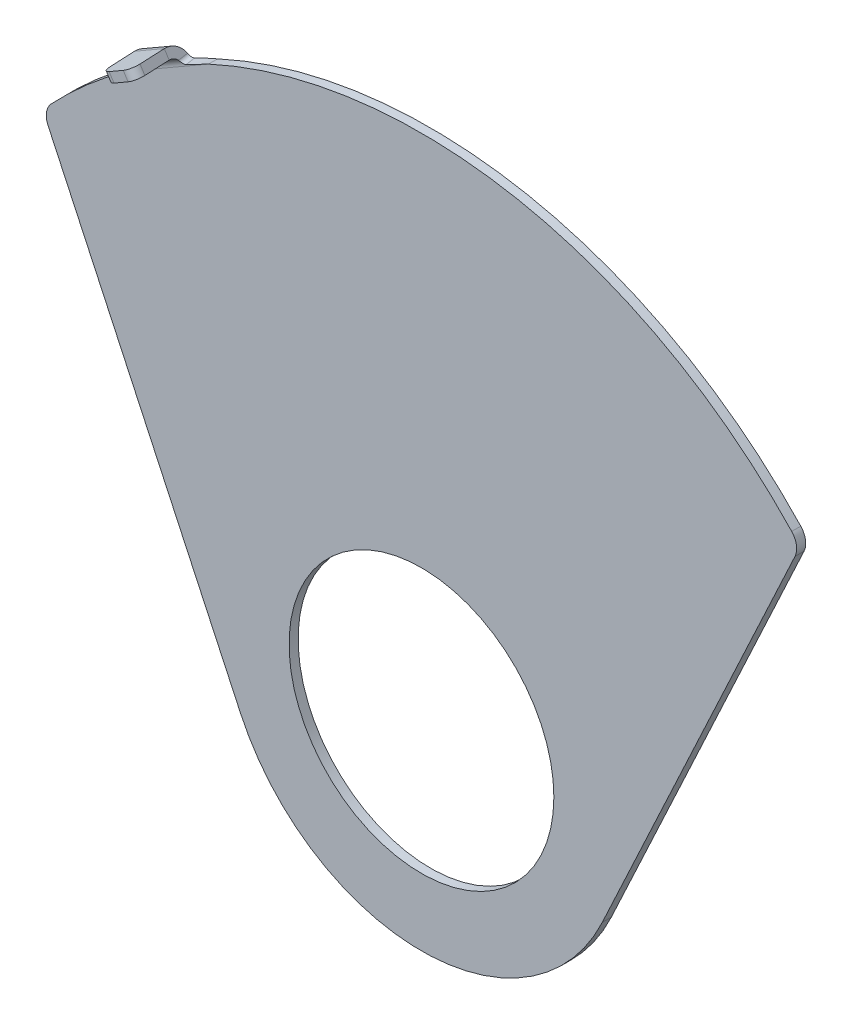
ISO-10303-21;
HEADER;
FILE_DESCRIPTION(('STEP AP214'),'2;1');
FILE_NAME('part.step','',(''),(''),'','','');
FILE_SCHEMA(('AUTOMOTIVE_DESIGN { 1 0 10303 214 1 1 1 1 }'));
ENDSEC;
DATA;
#1=APPLICATION_CONTEXT('core data for automotive mechanical design processes');
#2=APPLICATION_PROTOCOL_DEFINITION('international standard','automotive_design',2000,#1);
#3=PRODUCT_CONTEXT('',#1,'mechanical');
#4=PRODUCT('Part','Part','',(#3));
#5=PRODUCT_RELATED_PRODUCT_CATEGORY('part','',(#4));
#6=PRODUCT_DEFINITION_FORMATION('','',#4);
#7=PRODUCT_DEFINITION_CONTEXT('part definition',#1,'design');
#8=PRODUCT_DEFINITION('design','',#6,#7);
#9=PRODUCT_DEFINITION_SHAPE('','',#8);
#10=(LENGTH_UNIT() NAMED_UNIT(*) SI_UNIT(.MILLI.,.METRE.));
#11=(NAMED_UNIT(*) PLANE_ANGLE_UNIT() SI_UNIT($,.RADIAN.));
#12=(NAMED_UNIT(*) SI_UNIT($,.STERADIAN.) SOLID_ANGLE_UNIT());
#13=UNCERTAINTY_MEASURE_WITH_UNIT(LENGTH_MEASURE(1.E-05),#10,'distance_accuracy_value','');
#14=(GEOMETRIC_REPRESENTATION_CONTEXT(3) GLOBAL_UNCERTAINTY_ASSIGNED_CONTEXT((#13)) GLOBAL_UNIT_ASSIGNED_CONTEXT((#10,
#11,#12)) REPRESENTATION_CONTEXT('',''));
#15=CARTESIAN_POINT('',(0.,0.,0.));
#16=DIRECTION('',(0.,0.,1.));
#17=DIRECTION('',(1.,0.,0.));
#18=AXIS2_PLACEMENT_3D('',#15,#16,#17);
#19=CARTESIAN_POINT('',(-30.1153772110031,48.3613634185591,-0.168034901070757));
#20=DIRECTION('',(-0.866025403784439,-0.5,0.));
#21=DIRECTION('',(-0.0174497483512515,0.0302238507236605,-0.999390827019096));
#22=AXIS2_PLACEMENT_3D('',#19,#20,#21);
#23=PLANE('',#22);
#24=DIRECTION('',(0.0174497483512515,-0.0302238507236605,0.999390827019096));
#25=VECTOR('',#24,1.);
#26=CARTESIAN_POINT('',(-30.6150726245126,49.2268612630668,-0.133135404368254));
#27=LINE('',#26,#25);
#28=CARTESIAN_POINT('',(-30.5766085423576,49.1602395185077,2.06979899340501));
#29=VERTEX_POINT('',#28);
#30=CARTESIAN_POINT('',(-30.5290072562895,49.0777916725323,4.79604396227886));
#31=VERTEX_POINT('',#30);
#32=EDGE_CURVE('E555',#29,#31,#27,.T.);
#33=ORIENTED_EDGE('',*,*,#32,.F.);
#34=DIRECTION('',(0.499695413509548,-0.865497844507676,-0.0348994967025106));
#35=VECTOR('',#34,1.);
#36=CARTESIAN_POINT('',(-30.076913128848,48.2947416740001,2.03489949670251));
#37=LINE('',#36,#35);
#38=CARTESIAN_POINT('',(-30.076913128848,48.2947416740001,2.03489949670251));
#39=VERTEX_POINT('',#38);
#40=EDGE_CURVE('E509',#29,#39,#37,.T.);
#41=ORIENTED_EDGE('',*,*,#40,.T.);
#42=DIRECTION('',(0.0174497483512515,-0.0302238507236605,0.999390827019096));
#43=VECTOR('',#42,1.);
#44=CARTESIAN_POINT('',(-30.1153772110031,48.3613634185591,-0.168034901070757));
#45=LINE('',#44,#43);
#46=CARTESIAN_POINT('',(-30.02931184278,48.2122938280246,4.76114446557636));
#47=VERTEX_POINT('',#46);
#48=EDGE_CURVE('E547',#39,#47,#45,.T.);
#49=ORIENTED_EDGE('',*,*,#48,.T.);
#50=DIRECTION('',(-0.499695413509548,0.865497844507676,0.0348994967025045));
#51=VECTOR('',#50,1.);
#52=CARTESIAN_POINT('',(-30.02931184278,48.2122938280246,4.76114446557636));
#53=LINE('',#52,#51);
#54=EDGE_CURVE('E528',#47,#31,#53,.T.);
#55=ORIENTED_EDGE('',*,*,#54,.T.);
#56=EDGE_LOOP('',(#33,#41,#49,#55));
#57=FACE_BOUND('',#56,.T.);
#58=ADVANCED_FACE('F30',(#57),#23,.T.);
#59=CARTESIAN_POINT('',(-26.7209655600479,50.0820699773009,5.76053529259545));
#60=DIRECTION('',(0.866025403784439,0.5,0.));
#61=DIRECTION('',(0.0174497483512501,-0.0302238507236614,0.999390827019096));
#62=AXIS2_PLACEMENT_3D('',#59,#60,#61);
#63=PLANE('',#62);
#64=DIRECTION('',(-0.0174497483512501,0.0302238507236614,-0.999390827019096));
#65=VECTOR('',#64,1.);
#66=CARTESIAN_POINT('',(-26.7209655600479,50.0820699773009,5.76053529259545));
#67=LINE('',#66,#65);
#68=CARTESIAN_POINT('',(-26.7384153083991,50.1122938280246,4.76114446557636));
#69=VERTEX_POINT('',#68);
#70=CARTESIAN_POINT('',(-26.7860165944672,50.1947416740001,2.03489949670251));
#71=VERTEX_POINT('',#70);
#72=EDGE_CURVE('E552',#69,#71,#67,.T.);
#73=ORIENTED_EDGE('',*,*,#72,.T.);
#74=DIRECTION('',(-0.499695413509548,0.865497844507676,0.0348994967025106));
#75=VECTOR('',#74,1.);
#76=CARTESIAN_POINT('',(-26.7860165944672,50.1947416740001,2.03489949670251));
#77=LINE('',#76,#75);
#78=CARTESIAN_POINT('',(-27.2857120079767,51.0602395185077,2.06979899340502));
#79=VERTEX_POINT('',#78);
#80=EDGE_CURVE('E515',#71,#79,#77,.T.);
#81=ORIENTED_EDGE('',*,*,#80,.T.);
#82=DIRECTION('',(-0.0174497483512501,0.0302238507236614,-0.999390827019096));
#83=VECTOR('',#82,1.);
#84=CARTESIAN_POINT('',(-27.2206609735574,50.9475678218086,5.79543478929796));
#85=LINE('',#84,#83);
#86=CARTESIAN_POINT('',(-27.2381107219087,50.9777916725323,4.79604396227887));
#87=VERTEX_POINT('',#86);
#88=EDGE_CURVE('E188',#87,#79,#85,.T.);
#89=ORIENTED_EDGE('',*,*,#88,.F.);
#90=DIRECTION('',(-0.499695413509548,0.865497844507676,0.0348994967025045));
#91=VECTOR('',#90,1.);
#92=CARTESIAN_POINT('',(-26.7384153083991,50.1122938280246,4.76114446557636));
#93=LINE('',#92,#91);
#94=EDGE_CURVE('E536',#87,#69,#93,.F.);
#95=ORIENTED_EDGE('',*,*,#94,.T.);
#96=EDGE_LOOP('',(#73,#81,#89,#95));
#97=FACE_BOUND('',#96,.T.);
#98=ADVANCED_FACE('F272',(#97),#63,.T.);
#99=CARTESIAN_POINT('',(-29.4482982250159,51.0059487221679,-56.2016959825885));
#100=DIRECTION('',(0.499695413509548,-0.865497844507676,-0.0348994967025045));
#101=DIRECTION('',(0.741275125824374,0.448124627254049,-0.499695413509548));
#102=AXIS2_PLACEMENT_3D('',#99,#100,#101);
#103=PLANE('',#102);
#104=ORIENTED_EDGE('',*,*,#48,.F.);
#105=DIRECTION('',(0.866025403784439,0.5,0.));
#106=VECTOR('',#105,1.);
#107=CARTESIAN_POINT('',(-28.4314648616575,49.2447416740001,2.03489949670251));
#108=LINE('',#107,#106);
#109=EDGE_CURVE('E525',#39,#71,#108,.T.);
#110=ORIENTED_EDGE('',*,*,#109,.T.);
#111=ORIENTED_EDGE('',*,*,#72,.F.);
#112=CARTESIAN_POINT('',(-27.6044407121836,49.6122938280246,4.76114446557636));
#113=DIRECTION('',(0.499695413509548,-0.865497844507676,-0.0348994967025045));
#114=DIRECTION('',(0.741275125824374,0.448124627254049,-0.499695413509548));
#115=AXIS2_PLACEMENT_3D('',#112,#113,#114);
#116=CIRCLE('',#115,1.);
#117=CARTESIAN_POINT('',(-27.5869909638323,49.5820699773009,5.76053529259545));
#118=VERTEX_POINT('',#117);
#119=EDGE_CURVE('E531',#69,#118,#116,.T.);
#120=ORIENTED_EDGE('',*,*,#119,.T.);
#121=DIRECTION('',(0.866025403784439,0.5,0.));
#122=VECTOR('',#121,1.);
#123=CARTESIAN_POINT('',(-30.0118620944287,48.1820699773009,5.76053529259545));
#124=LINE('',#123,#122);
#125=CARTESIAN_POINT('',(-29.1458366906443,48.6820699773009,5.76053529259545));
#126=VERTEX_POINT('',#125);
#127=EDGE_CURVE('E549',#126,#118,#124,.T.);
#128=ORIENTED_EDGE('',*,*,#127,.F.);
#129=CARTESIAN_POINT('',(-29.1632864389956,48.7122938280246,4.76114446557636));
#130=DIRECTION('',(0.499695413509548,-0.865497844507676,-0.0348994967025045));
#131=DIRECTION('',(0.741275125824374,0.448124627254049,-0.499695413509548));
#132=AXIS2_PLACEMENT_3D('',#129,#130,#131);
#133=CIRCLE('',#132,1.);
#134=EDGE_CURVE('E533',#126,#47,#133,.T.);
#135=ORIENTED_EDGE('',*,*,#134,.T.);
#136=EDGE_LOOP('',(#104,#110,#111,#120,#128,#135));
#137=FACE_BOUND('',#136,.T.);
#138=ADVANCED_FACE('F268',(#137),#103,.T.);
#139=CARTESIAN_POINT('',(-29.9479936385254,51.8714465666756,-56.166796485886));
#140=DIRECTION('',(0.499695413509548,-0.865497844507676,-0.0348994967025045));
#141=DIRECTION('',(0.741275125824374,0.448124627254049,-0.499695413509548));
#142=AXIS2_PLACEMENT_3D('',#139,#140,#141);
#143=PLANE('',#142);
#144=DIRECTION('',(0.866025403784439,0.5,0.));
#145=VECTOR('',#144,1.);
#146=CARTESIAN_POINT('',(-28.9311602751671,50.1102395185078,2.06979899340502));
#147=LINE('',#146,#145);
#148=EDGE_CURVE('E520',#29,#79,#147,.T.);
#149=ORIENTED_EDGE('',*,*,#148,.F.);
#150=ORIENTED_EDGE('',*,*,#32,.T.);
#151=CARTESIAN_POINT('',(-29.6629818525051,49.5777916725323,4.79604396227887));
#152=DIRECTION('',(0.499695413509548,-0.865497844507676,-0.0348994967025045));
#153=DIRECTION('',(0.741275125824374,0.448124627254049,-0.499695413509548));
#154=AXIS2_PLACEMENT_3D('',#151,#152,#153);
#155=CIRCLE('',#154,1.);
#156=CARTESIAN_POINT('',(-29.6455321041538,49.5475678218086,5.79543478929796));
#157=VERTEX_POINT('',#156);
#158=EDGE_CURVE('E540',#31,#157,#155,.F.);
#159=ORIENTED_EDGE('',*,*,#158,.T.);
#160=DIRECTION('',(0.866025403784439,0.5,0.));
#161=VECTOR('',#160,1.);
#162=CARTESIAN_POINT('',(-30.5115575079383,49.0475678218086,5.79543478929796));
#163=LINE('',#162,#161);
#164=CARTESIAN_POINT('',(-28.0866863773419,50.4475678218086,5.79543478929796));
#165=VERTEX_POINT('',#164);
#166=EDGE_CURVE('E557',#157,#165,#163,.T.);
#167=ORIENTED_EDGE('',*,*,#166,.T.);
#168=CARTESIAN_POINT('',(-28.1041361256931,50.4777916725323,4.79604396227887));
#169=DIRECTION('',(0.499695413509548,-0.865497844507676,-0.0348994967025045));
#170=DIRECTION('',(0.741275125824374,0.448124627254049,-0.499695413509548));
#171=AXIS2_PLACEMENT_3D('',#168,#169,#170);
#172=CIRCLE('',#171,1.);
#173=EDGE_CURVE('E538',#165,#87,#172,.F.);
#174=ORIENTED_EDGE('',*,*,#173,.T.);
#175=ORIENTED_EDGE('',*,*,#88,.T.);
#176=EDGE_LOOP('',(#149,#150,#159,#167,#174,#175));
#177=FACE_BOUND('',#176,.T.);
#178=ADVANCED_FACE('F265',(#177),#143,.F.);
#179=CARTESIAN_POINT('',(-30.0118620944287,48.1820699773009,5.76053529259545));
#180=DIRECTION('',(0.0174497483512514,-0.0302238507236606,0.999390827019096));
#181=DIRECTION('',(-0.866025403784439,-0.5,0.));
#182=AXIS2_PLACEMENT_3D('',#179,#180,#181);
#183=PLANE('',#182);
#184=ORIENTED_EDGE('',*,*,#127,.T.);
#185=DIRECTION('',(-0.499695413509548,0.865497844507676,0.0348994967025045));
#186=VECTOR('',#185,1.);
#187=CARTESIAN_POINT('',(-27.5869909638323,49.5820699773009,5.76053529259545));
#188=LINE('',#187,#186);
#189=EDGE_CURVE('E542',#118,#165,#188,.T.);
#190=ORIENTED_EDGE('',*,*,#189,.T.);
#191=ORIENTED_EDGE('',*,*,#166,.F.);
#192=DIRECTION('',(-0.499695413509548,0.865497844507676,0.0348994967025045));
#193=VECTOR('',#192,1.);
#194=CARTESIAN_POINT('',(-29.1458366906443,48.6820699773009,5.76053529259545));
#195=LINE('',#194,#193);
#196=EDGE_CURVE('E545',#157,#126,#195,.F.);
#197=ORIENTED_EDGE('',*,*,#196,.T.);
#198=EDGE_LOOP('',(#184,#190,#191,#197));
#199=FACE_BOUND('',#198,.T.);
#200=ADVANCED_FACE('F263',(#199),#183,.T.);
#201=CARTESIAN_POINT('',(-27.6044407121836,49.6122938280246,4.76114446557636));
#202=DIRECTION('',(-0.499695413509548,0.865497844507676,0.0348994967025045));
#203=DIRECTION('',(-0.741275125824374,-0.448124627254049,0.499695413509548));
#204=AXIS2_PLACEMENT_3D('',#201,#202,#203);
#205=CYLINDRICAL_SURFACE('',#204,1.);
#206=ORIENTED_EDGE('',*,*,#119,.F.);
#207=ORIENTED_EDGE('',*,*,#94,.F.);
#208=ORIENTED_EDGE('',*,*,#173,.F.);
#209=ORIENTED_EDGE('',*,*,#189,.F.);
#210=EDGE_LOOP('',(#206,#207,#208,#209));
#211=FACE_BOUND('',#210,.T.);
#212=ADVANCED_FACE('F259',(#211),#205,.T.);
#213=CARTESIAN_POINT('',(-29.1632864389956,48.7122938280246,4.76114446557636));
#214=DIRECTION('',(-0.499695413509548,0.865497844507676,0.0348994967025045));
#215=DIRECTION('',(-0.741275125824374,-0.448124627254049,0.499695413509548));
#216=AXIS2_PLACEMENT_3D('',#213,#214,#215);
#217=CYLINDRICAL_SURFACE('',#216,1.);
#218=ORIENTED_EDGE('',*,*,#134,.F.);
#219=ORIENTED_EDGE('',*,*,#196,.F.);
#220=ORIENTED_EDGE('',*,*,#158,.F.);
#221=ORIENTED_EDGE('',*,*,#54,.F.);
#222=EDGE_LOOP('',(#218,#219,#220,#221));
#223=FACE_BOUND('',#222,.T.);
#224=ADVANCED_FACE('F256',(#223),#217,.T.);
#225=CARTESIAN_POINT('',(0.,0.,1.));
#226=DIRECTION('',(0.,0.,-1.));
#227=DIRECTION('',(-1.,0.,0.));
#228=AXIS2_PLACEMENT_3D('',#225,#226,#227);
#229=CYLINDRICAL_SURFACE('',#228,56.1);
#230=CARTESIAN_POINT('',(0.,0.,1.));
#231=DIRECTION('',(0.,0.,1.));
#232=DIRECTION('',(1.,0.,0.));
#233=AXIS2_PLACEMENT_3D('',#230,#231,#232);
#234=CIRCLE('',#233,56.1);
#235=CARTESIAN_POINT('',(-32.3878065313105,45.8065496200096,1.));
#236=VERTEX_POINT('',#235);
#237=CARTESIAN_POINT('',(-40.8255261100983,38.4770895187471,1.));
#238=VERTEX_POINT('',#237);
#239=EDGE_CURVE('E197',#236,#238,#234,.T.);
#240=ORIENTED_EDGE('',*,*,#239,.F.);
#241=CARTESIAN_POINT('',(-32.3878065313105,45.8065496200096,0.));
#242=CARTESIAN_POINT('',(-32.3878065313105,45.8065496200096,1.));
#243=B_SPLINE_CURVE_WITH_KNOTS('',1,(#241,#242),.UNSPECIFIED.,.F.,.F.,(2,2),(0.,1.),.UNSPECIFIED.);
#244=CARTESIAN_POINT('',(-32.3878065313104,45.8065496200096,0.));
#245=VERTEX_POINT('',#244);
#246=EDGE_CURVE('E177',#236,#245,#243,.F.);
#247=ORIENTED_EDGE('',*,*,#246,.T.);
#248=CARTESIAN_POINT('',(0.,0.,0.));
#249=DIRECTION('',(0.,0.,1.));
#250=DIRECTION('',(1.,0.,0.));
#251=AXIS2_PLACEMENT_3D('',#248,#249,#250);
#252=CIRCLE('',#251,56.1);
#253=CARTESIAN_POINT('',(-40.8255261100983,38.4770895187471,0.));
#254=VERTEX_POINT('',#253);
#255=EDGE_CURVE('E382',#245,#254,#252,.T.);
#256=ORIENTED_EDGE('',*,*,#255,.T.);
#257=DIRECTION('',(0.,0.,-1.));
#258=VECTOR('',#257,1.);
#259=CARTESIAN_POINT('',(-40.8255261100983,38.4770895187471,1.));
#260=LINE('',#259,#258);
#261=EDGE_CURVE('E205',#238,#254,#260,.T.);
#262=ORIENTED_EDGE('',*,*,#261,.F.);
#263=EDGE_LOOP('',(#240,#247,#256,#262));
#264=FACE_BOUND('',#263,.T.);
#265=ADVANCED_FACE('F203',(#264),#229,.T.);
#266=CARTESIAN_POINT('',(0.,0.,1.));
#267=DIRECTION('',(0.,0.,-1.));
#268=DIRECTION('',(-1.,0.,0.));
#269=AXIS2_PLACEMENT_3D('',#266,#267,#268);
#270=CYLINDRICAL_SURFACE('',#269,56.1);
#271=CARTESIAN_POINT('',(0.,0.,0.));
#272=DIRECTION('',(0.,0.,1.));
#273=DIRECTION('',(1.,0.,0.));
#274=AXIS2_PLACEMENT_3D('',#271,#272,#273);
#275=CIRCLE('',#274,56.1);
#276=CARTESIAN_POINT('',(40.8255261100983,38.4770895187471,0.));
#277=VERTEX_POINT('',#276);
#278=CARTESIAN_POINT('',(-23.4757323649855,50.9519380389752,0.));
#279=VERTEX_POINT('',#278);
#280=EDGE_CURVE('E228',#277,#279,#275,.T.);
#281=ORIENTED_EDGE('',*,*,#280,.T.);
#282=CARTESIAN_POINT('',(-23.4757323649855,50.9519380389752,1.));
#283=CARTESIAN_POINT('',(-23.4757323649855,50.9519380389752,0.));
#284=B_SPLINE_CURVE_WITH_KNOTS('',1,(#282,#283),.UNSPECIFIED.,.F.,.F.,(2,2),(0.,1.),.UNSPECIFIED.);
#285=CARTESIAN_POINT('',(-23.4757323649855,50.9519380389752,1.));
#286=VERTEX_POINT('',#285);
#287=EDGE_CURVE('E189',#279,#286,#284,.F.);
#288=ORIENTED_EDGE('',*,*,#287,.T.);
#289=CARTESIAN_POINT('',(0.,0.,1.));
#290=DIRECTION('',(0.,0.,1.));
#291=DIRECTION('',(1.,0.,0.));
#292=AXIS2_PLACEMENT_3D('',#289,#290,#291);
#293=CIRCLE('',#292,56.1);
#294=CARTESIAN_POINT('',(40.8255261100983,38.4770895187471,1.));
#295=VERTEX_POINT('',#294);
#296=EDGE_CURVE('E200',#295,#286,#293,.T.);
#297=ORIENTED_EDGE('',*,*,#296,.F.);
#298=DIRECTION('',(0.,0.,-1.));
#299=VECTOR('',#298,1.);
#300=CARTESIAN_POINT('',(40.8255261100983,38.4770895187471,1.));
#301=LINE('',#300,#299);
#302=EDGE_CURVE('E398',#295,#277,#301,.T.);
#303=ORIENTED_EDGE('',*,*,#302,.T.);
#304=EDGE_LOOP('',(#281,#288,#297,#303));
#305=FACE_BOUND('',#304,.T.);
#306=ADVANCED_FACE('F230',(#305),#270,.T.);
#307=CARTESIAN_POINT('',(0.,0.,0.));
#308=DIRECTION('',(0.,0.,1.));
#309=DIRECTION('',(1.,0.,0.));
#310=AXIS2_PLACEMENT_3D('',#307,#308,#309);
#311=PLANE('',#310);
#312=CARTESIAN_POINT('',(0.,0.,0.));
#313=DIRECTION('',(0.,0.,1.));
#314=DIRECTION('',(1.,0.,0.));
#315=AXIS2_PLACEMENT_3D('',#312,#313,#314);
#316=CIRCLE('',#315,14.6);
#317=CARTESIAN_POINT('',(14.6,0.,0.));
#318=VERTEX_POINT('',#317);
#319=EDGE_CURVE('E359',#318,#318,#316,.T.);
#320=ORIENTED_EDGE('',*,*,#319,.T.);
#321=EDGE_LOOP('',(#320));
#322=FACE_BOUND('',#321,.T.);
#323=ORIENTED_EDGE('',*,*,#255,.F.);
#324=DIRECTION('',(0.866025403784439,0.5,0.));
#325=VECTOR('',#324,1.);
#326=CARTESIAN_POINT('',(-27.931769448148,48.3792438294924,0.));
#327=LINE('',#326,#325);
#328=EDGE_CURVE('E201',#245,#279,#327,.T.);
#329=ORIENTED_EDGE('',*,*,#328,.T.);
#330=ORIENTED_EDGE('',*,*,#280,.F.);
#331=CARTESIAN_POINT('',(39.3700706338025,37.1053572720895,0.));
#332=DIRECTION('',(0.,0.,1.));
#333=DIRECTION('',(1.,0.,0.));
#334=AXIS2_PLACEMENT_3D('',#331,#332,#333);
#335=CIRCLE('',#334,2.);
#336=CARTESIAN_POINT('',(41.1826862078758,36.2601207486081,0.));
#337=VERTEX_POINT('',#336);
#338=EDGE_CURVE('E376',#337,#277,#335,.T.);
#339=ORIENTED_EDGE('',*,*,#338,.F.);
#340=DIRECTION('',(0.4226182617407,0.90630778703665,0.));
#341=VECTOR('',#340,1.);
#342=CARTESIAN_POINT('',(19.9387713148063,-9.29760175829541,0.));
#343=LINE('',#342,#341);
#344=CARTESIAN_POINT('',(19.9387713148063,-9.29760175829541,0.));
#345=VERTEX_POINT('',#344);
#346=EDGE_CURVE('E374',#345,#337,#343,.T.);
#347=ORIENTED_EDGE('',*,*,#346,.F.);
#348=CARTESIAN_POINT('',(0.,0.,0.));
#349=DIRECTION('',(0.,0.,1.));
#350=DIRECTION('',(1.,0.,0.));
#351=AXIS2_PLACEMENT_3D('',#348,#349,#350);
#352=CIRCLE('',#351,22.);
#353=CARTESIAN_POINT('',(-19.9387713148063,-9.29760175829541,0.));
#354=VERTEX_POINT('',#353);
#355=EDGE_CURVE('E371',#354,#345,#352,.T.);
#356=ORIENTED_EDGE('',*,*,#355,.F.);
#357=DIRECTION('',(-0.4226182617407,0.90630778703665,0.));
#358=VECTOR('',#357,1.);
#359=CARTESIAN_POINT('',(-19.9387713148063,-9.29760175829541,0.));
#360=LINE('',#359,#358);
#361=CARTESIAN_POINT('',(-41.1826862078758,36.2601207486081,0.));
#362=VERTEX_POINT('',#361);
#363=EDGE_CURVE('E381',#354,#362,#360,.T.);
#364=ORIENTED_EDGE('',*,*,#363,.T.);
#365=CARTESIAN_POINT('',(-39.3700706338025,37.1053572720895,0.));
#366=DIRECTION('',(0.,0.,-1.));
#367=DIRECTION('',(-1.,0.,0.));
#368=AXIS2_PLACEMENT_3D('',#365,#366,#367);
#369=CIRCLE('',#368,2.);
#370=EDGE_CURVE('E378',#362,#254,#369,.T.);
#371=ORIENTED_EDGE('',*,*,#370,.T.);
#372=EDGE_LOOP('',(#323,#329,#330,#339,#347,#356,#364,#371));
#373=FACE_BOUND('',#372,.T.);
#374=ADVANCED_FACE('F240',(#322,#373),#311,.F.);
#375=CARTESIAN_POINT('',(0.,0.,1.));
#376=DIRECTION('',(0.,0.,1.));
#377=DIRECTION('',(1.,0.,0.));
#378=AXIS2_PLACEMENT_3D('',#375,#376,#377);
#379=PLANE('',#378);
#380=DIRECTION('',(0.866025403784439,0.5,0.));
#381=VECTOR('',#380,1.);
#382=CARTESIAN_POINT('',(-27.931769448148,48.3792438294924,1.));
#383=LINE('',#382,#381);
#384=EDGE_CURVE('E166',#236,#286,#383,.T.);
#385=ORIENTED_EDGE('',*,*,#384,.F.);
#386=ORIENTED_EDGE('',*,*,#239,.T.);
#387=CARTESIAN_POINT('',(-39.3700706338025,37.1053572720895,1.));
#388=DIRECTION('',(0.,0.,-1.));
#389=DIRECTION('',(-1.,0.,0.));
#390=AXIS2_PLACEMENT_3D('',#387,#388,#389);
#391=CIRCLE('',#390,2.);
#392=CARTESIAN_POINT('',(-41.1826862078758,36.2601207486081,1.));
#393=VERTEX_POINT('',#392);
#394=EDGE_CURVE('E207',#393,#238,#391,.T.);
#395=ORIENTED_EDGE('',*,*,#394,.F.);
#396=DIRECTION('',(-0.4226182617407,0.90630778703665,0.));
#397=VECTOR('',#396,1.);
#398=CARTESIAN_POINT('',(-19.9387713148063,-9.29760175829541,1.));
#399=LINE('',#398,#397);
#400=CARTESIAN_POINT('',(-19.9387713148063,-9.29760175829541,1.));
#401=VERTEX_POINT('',#400);
#402=EDGE_CURVE('E209',#401,#393,#399,.T.);
#403=ORIENTED_EDGE('',*,*,#402,.F.);
#404=CARTESIAN_POINT('',(0.,0.,1.));
#405=DIRECTION('',(0.,0.,1.));
#406=DIRECTION('',(1.,0.,0.));
#407=AXIS2_PLACEMENT_3D('',#404,#405,#406);
#408=CIRCLE('',#407,22.);
#409=CARTESIAN_POINT('',(19.9387713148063,-9.29760175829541,1.));
#410=VERTEX_POINT('',#409);
#411=EDGE_CURVE('E385',#401,#410,#408,.T.);
#412=ORIENTED_EDGE('',*,*,#411,.T.);
#413=DIRECTION('',(0.4226182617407,0.90630778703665,0.));
#414=VECTOR('',#413,1.);
#415=CARTESIAN_POINT('',(19.9387713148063,-9.29760175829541,1.));
#416=LINE('',#415,#414);
#417=CARTESIAN_POINT('',(41.1826862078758,36.2601207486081,1.));
#418=VERTEX_POINT('',#417);
#419=EDGE_CURVE('E388',#410,#418,#416,.T.);
#420=ORIENTED_EDGE('',*,*,#419,.T.);
#421=CARTESIAN_POINT('',(39.3700706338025,37.1053572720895,1.));
#422=DIRECTION('',(0.,0.,1.));
#423=DIRECTION('',(1.,0.,0.));
#424=AXIS2_PLACEMENT_3D('',#421,#422,#423);
#425=CIRCLE('',#424,2.);
#426=EDGE_CURVE('E211',#418,#295,#425,.T.);
#427=ORIENTED_EDGE('',*,*,#426,.T.);
#428=ORIENTED_EDGE('',*,*,#296,.T.);
#429=EDGE_LOOP('',(#385,#386,#395,#403,#412,#420,#427,#428));
#430=FACE_BOUND('',#429,.T.);
#431=CARTESIAN_POINT('',(0.,0.,1.));
#432=DIRECTION('',(0.,0.,1.));
#433=DIRECTION('',(1.,0.,0.));
#434=AXIS2_PLACEMENT_3D('',#431,#432,#433);
#435=CIRCLE('',#434,14.6);
#436=CARTESIAN_POINT('',(14.6,0.,1.));
#437=VERTEX_POINT('',#436);
#438=EDGE_CURVE('E367',#437,#437,#435,.T.);
#439=ORIENTED_EDGE('',*,*,#438,.F.);
#440=EDGE_LOOP('',(#439));
#441=FACE_BOUND('',#440,.T.);
#442=ADVANCED_FACE('F194',(#430,#441),#379,.T.);
#443=CARTESIAN_POINT('',(0.,0.,1.));
#444=DIRECTION('',(0.,0.,-1.));
#445=DIRECTION('',(-1.,0.,0.));
#446=AXIS2_PLACEMENT_3D('',#443,#444,#445);
#447=CYLINDRICAL_SURFACE('',#446,22.);
#448=ORIENTED_EDGE('',*,*,#355,.T.);
#449=DIRECTION('',(0.,0.,-1.));
#450=VECTOR('',#449,1.);
#451=CARTESIAN_POINT('',(19.9387713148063,-9.29760175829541,1.));
#452=LINE('',#451,#450);
#453=EDGE_CURVE('E404',#410,#345,#452,.T.);
#454=ORIENTED_EDGE('',*,*,#453,.F.);
#455=ORIENTED_EDGE('',*,*,#411,.F.);
#456=DIRECTION('',(0.,0.,-1.));
#457=VECTOR('',#456,1.);
#458=CARTESIAN_POINT('',(-19.9387713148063,-9.29760175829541,1.));
#459=LINE('',#458,#457);
#460=EDGE_CURVE('E393',#401,#354,#459,.T.);
#461=ORIENTED_EDGE('',*,*,#460,.T.);
#462=EDGE_LOOP('',(#448,#454,#455,#461));
#463=FACE_BOUND('',#462,.T.);
#464=ADVANCED_FACE('F251',(#463),#447,.T.);
#465=CARTESIAN_POINT('',(19.9387713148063,-9.29760175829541,1.));
#466=DIRECTION('',(-0.90630778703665,0.4226182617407,0.));
#467=DIRECTION('',(-0.4226182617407,-0.90630778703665,0.));
#468=AXIS2_PLACEMENT_3D('',#465,#466,#467);
#469=PLANE('',#468);
#470=ORIENTED_EDGE('',*,*,#346,.T.);
#471=DIRECTION('',(0.,0.,-1.));
#472=VECTOR('',#471,1.);
#473=CARTESIAN_POINT('',(41.1826862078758,36.2601207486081,1.));
#474=LINE('',#473,#472);
#475=EDGE_CURVE('E401',#418,#337,#474,.T.);
#476=ORIENTED_EDGE('',*,*,#475,.F.);
#477=ORIENTED_EDGE('',*,*,#419,.F.);
#478=ORIENTED_EDGE('',*,*,#453,.T.);
#479=EDGE_LOOP('',(#470,#476,#477,#478));
#480=FACE_BOUND('',#479,.T.);
#481=ADVANCED_FACE('F247',(#480),#469,.F.);
#482=CARTESIAN_POINT('',(39.3700706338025,37.1053572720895,1.));
#483=DIRECTION('',(0.,0.,-1.));
#484=DIRECTION('',(-1.,0.,0.));
#485=AXIS2_PLACEMENT_3D('',#482,#483,#484);
#486=CYLINDRICAL_SURFACE('',#485,2.);
#487=ORIENTED_EDGE('',*,*,#338,.T.);
#488=ORIENTED_EDGE('',*,*,#302,.F.);
#489=ORIENTED_EDGE('',*,*,#426,.F.);
#490=ORIENTED_EDGE('',*,*,#475,.T.);
#491=EDGE_LOOP('',(#487,#488,#489,#490));
#492=FACE_BOUND('',#491,.T.);
#493=ADVANCED_FACE('F243',(#492),#486,.T.);
#494=CARTESIAN_POINT('',(-39.3700706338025,37.1053572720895,1.));
#495=DIRECTION('',(0.,0.,-1.));
#496=DIRECTION('',(-1.,0.,0.));
#497=AXIS2_PLACEMENT_3D('',#494,#495,#496);
#498=CYLINDRICAL_SURFACE('',#497,2.);
#499=ORIENTED_EDGE('',*,*,#370,.F.);
#500=DIRECTION('',(0.,0.,-1.));
#501=VECTOR('',#500,1.);
#502=CARTESIAN_POINT('',(-41.1826862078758,36.2601207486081,1.));
#503=LINE('',#502,#501);
#504=EDGE_CURVE('E395',#393,#362,#503,.T.);
#505=ORIENTED_EDGE('',*,*,#504,.F.);
#506=ORIENTED_EDGE('',*,*,#394,.T.);
#507=ORIENTED_EDGE('',*,*,#261,.T.);
#508=EDGE_LOOP('',(#499,#505,#506,#507));
#509=FACE_BOUND('',#508,.T.);
#510=ADVANCED_FACE('F246',(#509),#498,.T.);
#511=CARTESIAN_POINT('',(-19.9387713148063,-9.29760175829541,1.));
#512=DIRECTION('',(-0.90630778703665,-0.4226182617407,0.));
#513=DIRECTION('',(0.4226182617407,-0.90630778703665,0.));
#514=AXIS2_PLACEMENT_3D('',#511,#512,#513);
#515=PLANE('',#514);
#516=ORIENTED_EDGE('',*,*,#363,.F.);
#517=ORIENTED_EDGE('',*,*,#460,.F.);
#518=ORIENTED_EDGE('',*,*,#402,.T.);
#519=ORIENTED_EDGE('',*,*,#504,.T.);
#520=EDGE_LOOP('',(#516,#517,#518,#519));
#521=FACE_BOUND('',#520,.T.);
#522=ADVANCED_FACE('F644',(#521),#515,.T.);
#523=CARTESIAN_POINT('',(0.,0.,1.));
#524=DIRECTION('',(0.,0.,-1.));
#525=DIRECTION('',(-1.,0.,0.));
#526=AXIS2_PLACEMENT_3D('',#523,#524,#525);
#527=CYLINDRICAL_SURFACE('',#526,14.6);
#528=ORIENTED_EDGE('',*,*,#438,.T.);
#529=EDGE_LOOP('',(#528));
#530=FACE_BOUND('',#529,.T.);
#531=ORIENTED_EDGE('',*,*,#319,.F.);
#532=EDGE_LOOP('',(#531));
#533=FACE_BOUND('',#532,.T.);
#534=ADVANCED_FACE('F637',(#530,#533),#527,.F.);
#535=CARTESIAN_POINT('',(-26.2863211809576,49.3292438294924,2.));
#536=DIRECTION('',(0.866025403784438,0.500000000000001,0.));
#537=DIRECTION('',(-0.500000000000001,0.866025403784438,0.));
#538=AXIS2_PLACEMENT_3D('',#535,#536,#537);
#539=PLANE('',#538);
#540=CARTESIAN_POINT('',(-26.2863211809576,49.3292438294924,2.));
#541=DIRECTION('',(-0.866025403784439,-0.5,0.));
#542=DIRECTION('',(0.5,-0.866025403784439,0.));
#543=AXIS2_PLACEMENT_3D('',#540,#541,#542);
#544=CIRCLE('',#543,0.999999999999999);
#545=CARTESIAN_POINT('',(-26.5877134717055,49.8512705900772,1.20209602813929));
#546=VERTEX_POINT('',#545);
#547=EDGE_CURVE('E577',#71,#546,#544,.T.);
#548=ORIENTED_EDGE('',*,*,#547,.T.);
#549=CARTESIAN_POINT('',(-26.0250018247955,49.812964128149,-0.310843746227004));
#550=CARTESIAN_POINT('',(-26.4452659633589,49.6045442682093,-0.307147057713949));
#551=CARTESIAN_POINT('',(-26.678022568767,50.0076905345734,-0.24907899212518));
#552=CARTESIAN_POINT('',(-26.0185344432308,49.8041182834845,-0.224113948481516));
#553=CARTESIAN_POINT('',(-26.4392988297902,49.5942088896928,-0.220449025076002));
#554=CARTESIAN_POINT('',(-26.6726136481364,49.9983220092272,-0.162355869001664));
#555=CARTESIAN_POINT('',(-26.0120694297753,49.795280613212,-0.137383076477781));
#556=CARTESIAN_POINT('',(-26.4333378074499,49.5838840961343,-0.133848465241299));
#557=CARTESIAN_POINT('',(-26.6672068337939,49.9889571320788,-0.0756322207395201));
#558=CARTESIAN_POINT('',(-26.0039674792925,49.7842114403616,-0.0286508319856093));
#559=CARTESIAN_POINT('',(-26.4258702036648,49.5709498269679,-0.0253715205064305));
#560=CARTESIAN_POINT('',(-26.6604311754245,49.9772213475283,0.03309027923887));
#561=CARTESIAN_POINT('',(-26.0023283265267,49.7819722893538,-0.00665046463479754));
#562=CARTESIAN_POINT('',(-26.4243579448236,49.5683305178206,-0.0034044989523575));
#563=CARTESIAN_POINT('',(-26.6590603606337,49.9748470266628,0.0550886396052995));
#564=CARTESIAN_POINT('',(-26.0006893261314,49.779733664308,0.0153499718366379));
#565=CARTESIAN_POINT('',(-26.4228460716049,49.5657118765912,0.0185563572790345));
#566=CARTESIAN_POINT('',(-26.657689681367,49.9724729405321,0.0770870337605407));
#567=CARTESIAN_POINT('',(-25.9952812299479,49.7723470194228,0.0879433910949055));
#568=CARTESIAN_POINT('',(-26.4178513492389,49.5570607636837,0.0911076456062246));
#569=CARTESIAN_POINT('',(-26.6531669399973,49.9646393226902,0.149673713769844));
#570=CARTESIAN_POINT('',(-25.9898748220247,49.764966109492,0.160537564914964));
#571=CARTESIAN_POINT('',(-26.4128608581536,49.5484169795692,0.163591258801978));
#572=CARTESIAN_POINT('',(-26.6486456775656,49.9568082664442,0.222260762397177));
#573=CARTESIAN_POINT('',(-25.9774275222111,49.7479806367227,0.327728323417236));
#574=CARTESIAN_POINT('',(-26.4013631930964,49.5285024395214,0.330572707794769));
#575=CARTESIAN_POINT('',(-26.6382363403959,49.9387787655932,0.389434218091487));
#576=CARTESIAN_POINT('',(-25.9703878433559,49.7383800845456,0.422325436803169));
#577=CARTESIAN_POINT('',(-26.3948589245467,49.5172367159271,0.425023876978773));
#578=CARTESIAN_POINT('',(-26.6323493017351,49.9285821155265,0.48402088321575));
#579=CARTESIAN_POINT('',(-25.9568993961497,49.7199955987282,0.60366050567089));
#580=CARTESIAN_POINT('',(-26.3823908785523,49.4956414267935,0.606056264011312));
#581=CARTESIAN_POINT('',(-26.6210693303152,49.9090446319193,0.665334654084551));
#582=CARTESIAN_POINT('',(-25.9504501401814,49.7112101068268,0.690398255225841));
#583=CARTESIAN_POINT('',(-26.376425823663,49.4853096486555,0.692657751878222));
#584=CARTESIAN_POINT('',(-26.6156759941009,49.899703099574,0.752061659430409));
#585=CARTESIAN_POINT('',(-25.9382934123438,49.694658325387,0.853966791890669));
#586=CARTESIAN_POINT('',(-26.3651774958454,49.4658269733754,0.855944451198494));
#587=CARTESIAN_POINT('',(-26.6055094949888,49.8820942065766,0.915608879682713));
#588=CARTESIAN_POINT('',(-25.9325853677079,49.6868902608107,0.930797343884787));
#589=CARTESIAN_POINT('',(-26.35989280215,49.4566736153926,0.932652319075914));
#590=CARTESIAN_POINT('',(-26.6007358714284,49.8738260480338,0.992428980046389));
#591=CARTESIAN_POINT('',(-25.9268794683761,49.6791286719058,1.00762875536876));
#592=CARTESIAN_POINT('',(-26.3546130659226,49.4475288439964,1.00928053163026));
#593=CARTESIAN_POINT('',(-26.5959639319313,49.8655608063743,1.06924949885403));
#594=CARTESIAN_POINT('',(-25.9261435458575,49.6781276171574,1.01753812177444));
#595=CARTESIAN_POINT('',(-26.3539313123,49.4463480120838,1.01917526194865));
#596=CARTESIAN_POINT('',(-26.5953484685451,49.8644947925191,1.07915746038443));
#597=CARTESIAN_POINT('',(-25.9254076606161,49.6771266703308,1.02744750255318));
#598=CARTESIAN_POINT('',(-26.3532496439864,49.4451673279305,1.02906862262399));
#599=CARTESIAN_POINT('',(-26.5947330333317,49.8634288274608,1.08906542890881));
#600=CARTESIAN_POINT('',(-25.8989070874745,49.6410828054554,1.38432101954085));
#601=CARTESIAN_POINT('',(-26.3285882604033,49.4024525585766,1.38698568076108));
#602=CARTESIAN_POINT('',(-26.5725699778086,49.8250412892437,1.44588781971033));
#603=CARTESIAN_POINT('',(-25.8731880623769,49.6061720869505,1.73130276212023));
#604=CARTESIAN_POINT('',(-26.3047099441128,49.3610941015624,1.73337498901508));
#605=CARTESIAN_POINT('',(-26.5510568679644,49.7877794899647,1.79281080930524));
#606=CARTESIAN_POINT('',(-25.847514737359,49.5713936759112,2.07830212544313));
#607=CARTESIAN_POINT('',(-26.2809302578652,49.3199064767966,2.07816759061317));
#608=CARTESIAN_POINT('',(-26.5295782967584,49.750577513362,2.1397423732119));
#609=(BOUNDED_SURFACE() B_SPLINE_SURFACE(3,2,((#549,#550,#551),(#552,#553,#554),(#555,#556,
#557),(#558,#559,#560),(#561,#562,#563),(#564,#565,#566),(#567,#568,#569),(#570,#571,#572),
(#573,#574,#575),(#576,#577,#578),(#579,#580,#581),(#582,#583,#584),(#585,#586,#587),(#588,#589,
#590),(#591,#592,#593),(#594,#595,#596),(#597,#598,#599),(#600,#601,#602),(#603,#604,#605),
(#606,#607,#608)),.UNSPECIFIED.,.F.,.F.,.F.) B_SPLINE_SURFACE_WITH_KNOTS((4,2,3,2,2,2,3,2,4),(3,
3),(0.,0.26218568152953,0.328691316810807,0.548135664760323,0.834085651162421,1.09627133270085,
1.32850461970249,1.35845701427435,2.40719975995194),(0.,1.),
.UNSPECIFIED.) GEOMETRIC_REPRESENTATION_ITEM() RATIONAL_B_SPLINE_SURFACE(((1.,0.72926720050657,
1.),(1.,0.72845955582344,1.),(1.,0.727649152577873,1.),(1.,0.726629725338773,1.),(1.,
0.726423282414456,1.),(1.,0.726216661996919,1.),(1.,0.725534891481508,1.),(1.,0.724851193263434,
1.),(1.,0.723272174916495,1.),(1.,0.722375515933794,1.),(1.,0.720650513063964,1.),(1.,
0.719822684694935,1.),(1.,0.718256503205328,1.),(1.,0.71751873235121,1.),(1.,0.716778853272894,
1.),(1.,0.716683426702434,1.),(1.,0.71658796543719,1.),(1.,0.71314880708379,1.),(1.,
0.709762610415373,1.),(1.,0.706333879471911,1.))) REPRESENTATION_ITEM('') SURFACE());
#610=CARTESIAN_POINT('',(-26.5295782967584,49.750577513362,2.1397423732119));
#611=CARTESIAN_POINT('',(-26.5510568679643,49.7877794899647,1.79281080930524));
#612=CARTESIAN_POINT('',(-26.5725699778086,49.8250412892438,1.44588781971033));
#613=CARTESIAN_POINT('',(-26.5947330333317,49.8634288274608,1.08906542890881));
#614=CARTESIAN_POINT('',(-26.5953484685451,49.8644947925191,1.07915746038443));
#615=CARTESIAN_POINT('',(-26.5959639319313,49.8655608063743,1.06924949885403));
#616=CARTESIAN_POINT('',(-26.6007358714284,49.8738260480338,0.992428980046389));
#617=CARTESIAN_POINT('',(-26.6055094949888,49.8820942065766,0.915608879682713));
#618=CARTESIAN_POINT('',(-26.6156759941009,49.899703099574,0.752061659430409));
#619=CARTESIAN_POINT('',(-26.6210693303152,49.9090446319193,0.665334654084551));
#620=CARTESIAN_POINT('',(-26.6323493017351,49.9285821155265,0.48402088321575));
#621=CARTESIAN_POINT('',(-26.6382363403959,49.9387787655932,0.389434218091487));
#622=CARTESIAN_POINT('',(-26.6486456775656,49.9568082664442,0.222260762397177));
#623=CARTESIAN_POINT('',(-26.6531669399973,49.9646393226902,0.149673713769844));
#624=CARTESIAN_POINT('',(-26.657689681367,49.9724729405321,0.0770870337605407));
#625=CARTESIAN_POINT('',(-26.6590603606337,49.9748470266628,0.0550886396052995));
#626=CARTESIAN_POINT('',(-26.6604311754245,49.9772213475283,0.03309027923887));
#627=CARTESIAN_POINT('',(-26.6672068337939,49.9889571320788,-0.0756322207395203));
#628=CARTESIAN_POINT('',(-26.6726136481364,49.9983220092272,-0.162355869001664));
#629=CARTESIAN_POINT('',(-26.678022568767,50.0076905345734,-0.24907899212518));
#630=B_SPLINE_CURVE_WITH_KNOTS('',3,(#610,#611,#612,#613,#614,#615,#616,#617,#618,#619,#620,
#621,#622,#623,#624,#625,#626,#627,#628,#629),.UNSPECIFIED.,.F.,.F.,(4,2,3,2,2,2,3,2,4),(0.,
1.04874274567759,1.07869514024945,1.31092842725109,1.57311410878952,1.85906409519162,
2.07850844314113,2.14501407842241,2.40719975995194),.UNSPECIFIED.);
#631=CARTESIAN_POINT('',(-26.6537752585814,49.9656929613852,0.139916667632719));
#632=VERTEX_POINT('',#631);
#633=EDGE_CURVE('E474',#546,#632,#630,.T.);
#634=ORIENTED_EDGE('',*,*,#633,.T.);
#635=CARTESIAN_POINT('',(-26.2863211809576,49.3292438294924,2.));
#636=DIRECTION('',(-0.866025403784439,-0.5,0.));
#637=DIRECTION('',(0.5,-0.866025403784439,0.));
#638=AXIS2_PLACEMENT_3D('',#635,#636,#637);
#639=CIRCLE('',#638,2.);
#640=EDGE_CURVE('E429',#79,#632,#639,.T.);
#641=ORIENTED_EDGE('',*,*,#640,.F.);
#642=ORIENTED_EDGE('',*,*,#80,.F.);
#643=EDGE_LOOP('',(#548,#634,#641,#642));
#644=FACE_BOUND('',#643,.T.);
#645=ADVANCED_FACE('F329',(#644),#539,.T.);
#646=CARTESIAN_POINT('',(-23.4757323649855,50.9519380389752,0.));
#647=CARTESIAN_POINT('',(-23.6395129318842,50.8815343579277,0.));
#648=CARTESIAN_POINT('',(-23.7836915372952,50.8191952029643,0.00032225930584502));
#649=CARTESIAN_POINT('',(-23.970554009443,50.7377785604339,0.000944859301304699));
#650=CARTESIAN_POINT('',(-24.0279406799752,50.712655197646,0.00117670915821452));
#651=CARTESIAN_POINT('',(-24.106669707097,50.6779938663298,0.00152798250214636));
#652=CARTESIAN_POINT('',(-24.1316875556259,50.666944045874,0.00164572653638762));
#653=CARTESIAN_POINT('',(-24.167376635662,50.6511253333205,0.00181982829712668));
#654=CARTESIAN_POINT('',(-24.1789667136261,50.6459784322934,0.0018774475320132));
#655=CARTESIAN_POINT('',(-24.1958924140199,50.6384470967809,0.00196285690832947));
#656=CARTESIAN_POINT('',(-24.2014577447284,50.6359681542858,0.00199115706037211));
#657=CARTESIAN_POINT('',(-24.2096908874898,50.6322969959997,0.00203330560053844));
#658=CARTESIAN_POINT('',(-24.2124161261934,50.6310811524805,0.00204730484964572));
#659=CARTESIAN_POINT('',(-24.2178283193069,50.6286652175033,0.0020751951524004));
#660=CARTESIAN_POINT('',(-24.219476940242,50.627929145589,0.00208370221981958));
#661=CARTESIAN_POINT('',(-24.3417797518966,50.5732733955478,0.00271786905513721));
#662=CARTESIAN_POINT('',(-24.4627623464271,50.5184349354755,0.00344945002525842));
#663=CARTESIAN_POINT('',(-24.6478142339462,50.4334172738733,0.00468700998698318));
#664=CARTESIAN_POINT('',(-24.7100945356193,50.4046180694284,0.00512291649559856));
#665=CARTESIAN_POINT('',(-24.8358477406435,50.3460995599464,0.00603597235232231));
#666=CARTESIAN_POINT('',(-24.9000283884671,50.316046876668,0.00651859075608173));
#667=CARTESIAN_POINT('',(-25.0901127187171,50.2265088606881,0.00798746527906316));
#668=CARTESIAN_POINT('',(-25.2145665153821,50.1671786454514,0.00900044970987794));
#669=CARTESIAN_POINT('',(-25.3978452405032,50.0787289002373,0.01051063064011));
#670=CARTESIAN_POINT('',(-25.4583711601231,50.0493365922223,0.011012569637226));
#671=CARTESIAN_POINT('',(-25.5483098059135,50.0053849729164,0.0117566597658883));
#672=CARTESIAN_POINT('',(-25.5781476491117,49.9907572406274,0.0120032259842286));
#673=CARTESIAN_POINT('',(-25.622691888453,49.9688499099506,0.012370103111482));
#674=CARTESIAN_POINT('',(-25.6375045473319,49.9615531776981,0.0124919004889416));
#675=CARTESIAN_POINT('',(-25.6596704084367,49.9506166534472,0.0126737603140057));
#676=CARTESIAN_POINT('',(-25.6670501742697,49.9469725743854,0.0127342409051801));
#677=CARTESIAN_POINT('',(-25.6781065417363,49.9415086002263,0.0128247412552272));
#678=CARTESIAN_POINT('',(-25.6817897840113,49.9396876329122,0.0128548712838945));
#679=CARTESIAN_POINT('',(-25.689151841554,49.9360464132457,0.0129150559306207));
#680=CARTESIAN_POINT('',(-25.6937658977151,49.9337632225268,0.0129527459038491));
#681=CARTESIAN_POINT('',(-25.8719543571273,49.8455610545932,0.014407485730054));
#682=CARTESIAN_POINT('',(-26.1138174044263,49.7228967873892,0.0162063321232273));
#683=CARTESIAN_POINT('',(-26.4220854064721,49.5643943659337,0.0185176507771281));
#684=CARTESIAN_POINT('',(-23.4757323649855,50.9519380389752,1.));
#685=CARTESIAN_POINT('',(-23.6342831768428,50.8724762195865,1.));
#686=CARTESIAN_POINT('',(-23.7739363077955,50.8022986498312,1.00016112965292));
#687=CARTESIAN_POINT('',(-23.9550681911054,50.7109563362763,1.00047242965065));
#688=CARTESIAN_POINT('',(-24.0107208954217,50.6828296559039,1.00058835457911));
#689=CARTESIAN_POINT('',(-24.0871131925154,50.6441209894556,1.00076399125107));
#690=CARTESIAN_POINT('',(-24.1113961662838,50.6317983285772,1.00082286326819));
#691=CARTESIAN_POINT('',(-24.146048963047,50.6141847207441,1.00090991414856));
#692=CARTESIAN_POINT('',(-24.1573046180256,50.6084585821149,1.00093872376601));
#693=CARTESIAN_POINT('',(-24.1737451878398,50.6000869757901,1.00098142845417));
#694=CARTESIAN_POINT('',(-24.1791515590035,50.5973327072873,1.00099557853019));
#695=CARTESIAN_POINT('',(-24.187150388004,50.5932557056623,1.00101665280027));
#696=CARTESIAN_POINT('',(-24.1897982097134,50.5919057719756,1.00102365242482));
#697=CARTESIAN_POINT('',(-24.1950569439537,50.5892240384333,1.0010375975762));
#698=CARTESIAN_POINT('',(-24.1966588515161,50.5884070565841,1.00104185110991));
#699=CARTESIAN_POINT('',(-24.3155071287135,50.5277678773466,1.00135893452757));
#700=CARTESIAN_POINT('',(-24.4332397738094,50.4673003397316,1.00172472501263));
#701=CARTESIAN_POINT('',(-24.6135670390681,50.3740993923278,1.00234350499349));
#702=CARTESIAN_POINT('',(-24.6742975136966,50.3426158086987,1.0025614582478));
#703=CARTESIAN_POINT('',(-24.7970011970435,50.2788153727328,1.00301798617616));
#704=CARTESIAN_POINT('',(-24.8596658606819,50.2461369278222,1.00325929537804));
#705=CARTESIAN_POINT('',(-25.0453751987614,50.1490212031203,1.00399373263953));
#706=CARTESIAN_POINT('',(-25.1671176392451,50.08499478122,1.00450022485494));
#707=CARTESIAN_POINT('',(-25.3466364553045,49.9900326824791,1.00525531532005));
#708=CARTESIAN_POINT('',(-25.405960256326,49.9585582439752,1.00550628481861));
#709=CARTESIAN_POINT('',(-25.4941723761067,49.9116161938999,1.00587832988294));
#710=CARTESIAN_POINT('',(-25.5234474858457,49.8960137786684,1.00600161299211));
#711=CARTESIAN_POINT('',(-25.5671667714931,49.8726775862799,1.00618505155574));
#712=CARTESIAN_POINT('',(-25.581707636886,49.8649100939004,1.00624595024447));
#713=CARTESIAN_POINT('',(-25.6034705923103,49.8532757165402,1.006336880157));
#714=CARTESIAN_POINT('',(-25.6107168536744,49.8494004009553,1.00636712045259));
#715=CARTESIAN_POINT('',(-25.6215741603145,49.8435916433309,1.00641237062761));
#716=CARTESIAN_POINT('',(-25.6251912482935,49.841656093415,1.00642743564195));
#717=CARTESIAN_POINT('',(-25.6324213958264,49.8377863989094,1.00645752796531));
#718=CARTESIAN_POINT('',(-25.6369530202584,49.8353604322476,1.00647637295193));
#719=CARTESIAN_POINT('',(-25.8119642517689,49.741655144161,1.00720374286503));
#720=CARTESIAN_POINT('',(-26.050152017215,49.6126250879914,1.00810316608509));
#721=CARTESIAN_POINT('',(-26.3542032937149,49.4468190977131,1.00925882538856));
#722=B_SPLINE_SURFACE_WITH_KNOTS('',1,3,((#646,#647,#648,#649,#650,#651,#652,#653,#654,#655,
#656,#657,#658,#659,#660,#661,#662,#663,#664,#665,#666,#667,#668,#669,#670,#671,#672,#673,#674,
#675,#676,#677,#678,#679,#680,#681,#682,#683),(#684,#685,#686,#687,#688,#689,#690,#691,#692,
#693,#694,#695,#696,#697,#698,#699,#700,#701,#702,#703,#704,#705,#706,#707,#708,#709,#710,#711,
#712,#713,#714,#715,#716,#717,#718,#719,#720,#721)),.UNSPECIFIED.,.F.,.F.,.F.,(2,2),(4,2,2,2,2,
2,2,2,2,2,2,2,2,2,2,2,2,2,4),(0.,1.),(0.,0.125,0.1875,0.21875,0.234375,0.2421875,0.24609375,
0.25,0.375,0.4375,0.5,0.625,0.6875,0.71875,0.734375,0.7421875,0.74609375,0.75,1.),.UNSPECIFIED.);
#723=CARTESIAN_POINT('',(-23.4757323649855,50.9519380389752,0.));
#724=CARTESIAN_POINT('',(-23.6395129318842,50.8815343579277,0.));
#725=CARTESIAN_POINT('',(-23.7836915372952,50.8191952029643,0.00032225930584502));
#726=CARTESIAN_POINT('',(-23.970554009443,50.7377785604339,0.000944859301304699));
#727=CARTESIAN_POINT('',(-24.0279406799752,50.712655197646,0.00117670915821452));
#728=CARTESIAN_POINT('',(-24.106669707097,50.6779938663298,0.00152798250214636));
#729=CARTESIAN_POINT('',(-24.1316875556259,50.666944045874,0.00164572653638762));
#730=CARTESIAN_POINT('',(-24.167376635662,50.6511253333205,0.00181982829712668));
#731=CARTESIAN_POINT('',(-24.1789667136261,50.6459784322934,0.0018774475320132));
#732=CARTESIAN_POINT('',(-24.1958924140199,50.6384470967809,0.00196285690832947));
#733=CARTESIAN_POINT('',(-24.2014577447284,50.6359681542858,0.00199115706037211));
#734=CARTESIAN_POINT('',(-24.2096908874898,50.6322969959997,0.00203330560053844));
#735=CARTESIAN_POINT('',(-24.2124161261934,50.6310811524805,0.00204730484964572));
#736=CARTESIAN_POINT('',(-24.2178283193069,50.6286652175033,0.0020751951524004));
#737=CARTESIAN_POINT('',(-24.219476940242,50.627929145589,0.00208370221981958));
#738=CARTESIAN_POINT('',(-24.3417797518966,50.5732733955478,0.00271786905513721));
#739=CARTESIAN_POINT('',(-24.4627623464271,50.5184349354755,0.00344945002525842));
#740=CARTESIAN_POINT('',(-24.6478142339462,50.4334172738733,0.00468700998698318));
#741=CARTESIAN_POINT('',(-24.7100945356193,50.4046180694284,0.00512291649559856));
#742=CARTESIAN_POINT('',(-24.8358477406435,50.3460995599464,0.00603597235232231));
#743=CARTESIAN_POINT('',(-24.9000283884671,50.316046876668,0.00651859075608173));
#744=CARTESIAN_POINT('',(-25.0901127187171,50.2265088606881,0.00798746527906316));
#745=CARTESIAN_POINT('',(-25.2145665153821,50.1671786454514,0.00900044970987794));
#746=CARTESIAN_POINT('',(-25.3978452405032,50.0787289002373,0.01051063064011));
#747=CARTESIAN_POINT('',(-25.4583711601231,50.0493365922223,0.011012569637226));
#748=CARTESIAN_POINT('',(-25.5483098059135,50.0053849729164,0.0117566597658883));
#749=CARTESIAN_POINT('',(-25.5781476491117,49.9907572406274,0.0120032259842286));
#750=CARTESIAN_POINT('',(-25.622691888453,49.9688499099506,0.012370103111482));
#751=CARTESIAN_POINT('',(-25.6375045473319,49.9615531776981,0.0124919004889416));
#752=CARTESIAN_POINT('',(-25.6596704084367,49.9506166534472,0.0126737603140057));
#753=CARTESIAN_POINT('',(-25.6670501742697,49.9469725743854,0.0127342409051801));
#754=CARTESIAN_POINT('',(-25.6781065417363,49.9415086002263,0.0128247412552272));
#755=CARTESIAN_POINT('',(-25.6817897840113,49.9396876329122,0.0128548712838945));
#756=CARTESIAN_POINT('',(-25.689151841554,49.9360464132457,0.0129150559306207));
#757=CARTESIAN_POINT('',(-25.6937658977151,49.9337632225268,0.0129527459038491));
#758=CARTESIAN_POINT('',(-25.8719543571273,49.8455610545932,0.014407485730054));
#759=CARTESIAN_POINT('',(-26.1138174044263,49.7228967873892,0.0162063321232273));
#760=CARTESIAN_POINT('',(-26.4220854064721,49.5643943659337,0.0185176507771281));
#761=B_SPLINE_CURVE_WITH_KNOTS('',3,(#723,#724,#725,#726,#727,#728,#729,#730,#731,#732,#733,
#734,#735,#736,#737,#738,#739,#740,#741,#742,#743,#744,#745,#746,#747,#748,#749,#750,#751,#752,
#753,#754,#755,#756,#757,#758,#759,#760),.UNSPECIFIED.,.F.,.F.,(4,2,2,2,2,2,2,2,2,2,2,2,2,2,2,2,
2,2,4),(0.,0.125,0.1875,0.21875,0.234375,0.2421875,0.24609375,0.25,0.375,0.4375,0.5,0.625,
0.6875,0.71875,0.734375,0.7421875,0.74609375,0.75,1.),.UNSPECIFIED.);
#762=CARTESIAN_POINT('',(-26.0006892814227,49.779733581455,0.0153503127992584));
#763=VERTEX_POINT('',#762);
#764=EDGE_CURVE('E427',#279,#763,#761,.T.);
#765=CARTESIAN_POINT('',(-26.0250018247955,49.812964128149,-0.310843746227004));
#766=CARTESIAN_POINT('',(-26.0185344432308,49.8041182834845,-0.224113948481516));
#767=CARTESIAN_POINT('',(-26.0120694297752,49.795280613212,-0.137383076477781));
#768=CARTESIAN_POINT('',(-26.0039674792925,49.7842114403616,-0.0286508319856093));
#769=CARTESIAN_POINT('',(-26.0023283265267,49.7819722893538,-0.00665046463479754));
#770=CARTESIAN_POINT('',(-26.0006893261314,49.779733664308,0.0153499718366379));
#771=CARTESIAN_POINT('',(-25.9952812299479,49.7723470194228,0.0879433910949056));
#772=CARTESIAN_POINT('',(-25.9898748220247,49.764966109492,0.160537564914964));
#773=CARTESIAN_POINT('',(-25.9774275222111,49.7479806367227,0.327728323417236));
#774=CARTESIAN_POINT('',(-25.9703878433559,49.7383800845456,0.422325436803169));
#775=CARTESIAN_POINT('',(-25.9568993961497,49.7199955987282,0.60366050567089));
#776=CARTESIAN_POINT('',(-25.9504501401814,49.7112101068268,0.690398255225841));
#777=CARTESIAN_POINT('',(-25.9382934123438,49.694658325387,0.853966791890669));
#778=CARTESIAN_POINT('',(-25.9325853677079,49.6868902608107,0.930797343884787));
#779=CARTESIAN_POINT('',(-25.9268794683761,49.6791286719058,1.00762875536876));
#780=CARTESIAN_POINT('',(-25.9261435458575,49.6781276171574,1.01753812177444));
#781=CARTESIAN_POINT('',(-25.9254076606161,49.6771266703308,1.02744750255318));
#782=CARTESIAN_POINT('',(-25.8989070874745,49.6410828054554,1.38432101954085));
#783=CARTESIAN_POINT('',(-25.8731880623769,49.6061720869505,1.73130276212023));
#784=CARTESIAN_POINT('',(-25.847514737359,49.5713936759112,2.07830212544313));
#785=B_SPLINE_CURVE_WITH_KNOTS('',3,(#765,#766,#767,#768,#769,#770,#771,#772,#773,#774,#775,
#776,#777,#778,#779,#780,#781,#782,#783,#784),.UNSPECIFIED.,.F.,.F.,(4,2,3,2,2,2,3,2,4),(0.,
0.26218568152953,0.328691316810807,0.548135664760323,0.834085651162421,1.09627133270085,
1.32850461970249,1.35845701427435,2.40719975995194),.UNSPECIFIED.);
#786=CARTESIAN_POINT('',(-25.9268794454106,49.6791286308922,1.00762892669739));
#787=VERTEX_POINT('',#786);
#788=EDGE_CURVE('E57',#763,#787,#785,.T.);
#789=CARTESIAN_POINT('',(-26.3542032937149,49.4468190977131,1.00925882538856));
#790=CARTESIAN_POINT('',(-26.050152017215,49.6126250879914,1.00810316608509));
#791=CARTESIAN_POINT('',(-25.8119642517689,49.741655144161,1.00720374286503));
#792=CARTESIAN_POINT('',(-25.6369530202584,49.8353604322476,1.00647637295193));
#793=CARTESIAN_POINT('',(-25.6324213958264,49.8377863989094,1.00645752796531));
#794=CARTESIAN_POINT('',(-25.6251912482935,49.841656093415,1.00642743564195));
#795=CARTESIAN_POINT('',(-25.6215741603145,49.8435916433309,1.00641237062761));
#796=CARTESIAN_POINT('',(-25.6107168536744,49.8494004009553,1.00636712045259));
#797=CARTESIAN_POINT('',(-25.6034705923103,49.8532757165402,1.006336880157));
#798=CARTESIAN_POINT('',(-25.581707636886,49.8649100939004,1.00624595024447));
#799=CARTESIAN_POINT('',(-25.5671667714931,49.8726775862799,1.00618505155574));
#800=CARTESIAN_POINT('',(-25.5234474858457,49.8960137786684,1.00600161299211));
#801=CARTESIAN_POINT('',(-25.4941723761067,49.9116161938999,1.00587832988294));
#802=CARTESIAN_POINT('',(-25.405960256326,49.9585582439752,1.00550628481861));
#803=CARTESIAN_POINT('',(-25.3466364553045,49.9900326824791,1.00525531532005));
#804=CARTESIAN_POINT('',(-25.1671176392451,50.08499478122,1.00450022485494));
#805=CARTESIAN_POINT('',(-25.0453751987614,50.1490212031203,1.00399373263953));
#806=CARTESIAN_POINT('',(-24.8596658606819,50.2461369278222,1.00325929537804));
#807=CARTESIAN_POINT('',(-24.7970011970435,50.2788153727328,1.00301798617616));
#808=CARTESIAN_POINT('',(-24.6742975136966,50.3426158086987,1.0025614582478));
#809=CARTESIAN_POINT('',(-24.6135670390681,50.3740993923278,1.00234350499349));
#810=CARTESIAN_POINT('',(-24.4332397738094,50.4673003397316,1.00172472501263));
#811=CARTESIAN_POINT('',(-24.3155071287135,50.5277678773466,1.00135893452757));
#812=CARTESIAN_POINT('',(-24.1966588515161,50.5884070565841,1.00104185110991));
#813=CARTESIAN_POINT('',(-24.1950569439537,50.5892240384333,1.0010375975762));
#814=CARTESIAN_POINT('',(-24.1897982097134,50.5919057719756,1.00102365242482));
#815=CARTESIAN_POINT('',(-24.187150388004,50.5932557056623,1.00101665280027));
#816=CARTESIAN_POINT('',(-24.1791515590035,50.5973327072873,1.00099557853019));
#817=CARTESIAN_POINT('',(-24.1737451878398,50.6000869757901,1.00098142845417));
#818=CARTESIAN_POINT('',(-24.1573046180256,50.6084585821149,1.00093872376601));
#819=CARTESIAN_POINT('',(-24.146048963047,50.6141847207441,1.00090991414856));
#820=CARTESIAN_POINT('',(-24.1113961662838,50.6317983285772,1.00082286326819));
#821=CARTESIAN_POINT('',(-24.0871131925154,50.6441209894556,1.00076399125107));
#822=CARTESIAN_POINT('',(-24.0107208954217,50.6828296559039,1.00058835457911));
#823=CARTESIAN_POINT('',(-23.9550681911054,50.7109563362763,1.00047242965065));
#824=CARTESIAN_POINT('',(-23.7739363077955,50.8022986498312,1.00016112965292));
#825=CARTESIAN_POINT('',(-23.6342831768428,50.8724762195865,1.));
#826=CARTESIAN_POINT('',(-23.4757323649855,50.9519380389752,1.));
#827=B_SPLINE_CURVE_WITH_KNOTS('',3,(#789,#790,#791,#792,#793,#794,#795,#796,#797,#798,#799,
#800,#801,#802,#803,#804,#805,#806,#807,#808,#809,#810,#811,#812,#813,#814,#815,#816,#817,#818,
#819,#820,#821,#822,#823,#824,#825,#826),.UNSPECIFIED.,.F.,.F.,(4,2,2,2,2,2,2,2,2,2,2,2,2,2,2,2,
2,2,4),(0.,0.25,0.25390625,0.2578125,0.265625,0.28125,0.3125,0.375,0.5,0.5625,0.625,0.75,
0.75390625,0.7578125,0.765625,0.78125,0.8125,0.875,1.),.UNSPECIFIED.);
#828=EDGE_CURVE('E173',#286,#787,#827,.F.);
#829=ORIENTED_EDGE('',*,*,#764,.T.);
#830=ORIENTED_EDGE('',*,*,#788,.T.);
#831=ORIENTED_EDGE('',*,*,#828,.F.);
#832=ORIENTED_EDGE('',*,*,#287,.F.);
#833=EDGE_LOOP('',(#829,#830,#831,#832));
#834=FACE_BOUND('',#833,.T.);
#835=ADVANCED_FACE('F331',(#834),#722,.F.);
#836=CARTESIAN_POINT('',(-29.712981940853,47.6643943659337,0.0185176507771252));
#837=CARTESIAN_POINT('',(-29.8623658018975,47.5680327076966,0.017317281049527));
#838=CARTESIAN_POINT('',(-29.9938472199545,47.4828182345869,0.0162719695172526));
#839=CARTESIAN_POINT('',(-30.1642186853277,47.3717224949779,0.0148977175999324));
#840=CARTESIAN_POINT('',(-30.2165340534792,47.337478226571,0.0144719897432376));
#841=CARTESIAN_POINT('',(-30.2882947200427,47.2902938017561,0.0138777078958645));
#842=CARTESIAN_POINT('',(-30.3110962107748,47.2752626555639,0.0136870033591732));
#843=CARTESIAN_POINT('',(-30.3436203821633,47.2537614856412,0.0134115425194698));
#844=CARTESIAN_POINT('',(-30.3541820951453,47.2467686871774,0.0133214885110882));
#845=CARTESIAN_POINT('',(-30.3696051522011,47.2365408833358,0.0131889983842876));
#846=CARTESIAN_POINT('',(-30.3746762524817,47.2331751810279,0.013145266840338));
#847=CARTESIAN_POINT('',(-30.3821780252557,47.2281919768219,0.0130803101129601));
#848=CARTESIAN_POINT('',(-30.3846611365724,47.2265418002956,0.013058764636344));
#849=CARTESIAN_POINT('',(-30.3895924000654,47.2232632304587,0.0130158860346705));
#850=CARTESIAN_POINT('',(-30.3910992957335,47.2222612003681,0.0130027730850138));
#851=CARTESIAN_POINT('',(-30.5023729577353,47.148213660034,0.0120309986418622));
#852=CARTESIAN_POINT('',(-30.6124050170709,47.07414790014,0.0110375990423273));
#853=CARTESIAN_POINT('',(-30.7806462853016,46.9596521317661,0.0095260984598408));
#854=CARTESIAN_POINT('',(-30.837258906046,46.9209206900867,0.00901881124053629));
#855=CARTESIAN_POINT('',(-30.9515481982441,46.8423248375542,0.00800789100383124));
#856=CARTESIAN_POINT('',(-31.0099347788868,46.8019673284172,0.00749820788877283));
#857=CARTESIAN_POINT('',(-31.1824306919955,46.6821531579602,0.00602814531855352));
#858=CARTESIAN_POINT('',(-31.2953144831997,46.6029658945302,0.00511265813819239));
#859=CARTESIAN_POINT('',(-31.4614700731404,46.4852184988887,0.00387360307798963));
#860=CARTESIAN_POINT('',(-31.5163269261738,46.4461416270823,0.00348297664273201));
#861=CARTESIAN_POINT('',(-31.5978197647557,46.3877848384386,0.00293555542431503));
#862=CARTESIAN_POINT('',(-31.6248519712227,46.3683756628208,0.00275950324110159));
#863=CARTESIAN_POINT('',(-31.6652021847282,46.3393265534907,0.00250568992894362));
#864=CARTESIAN_POINT('',(-31.6786192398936,46.3296542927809,0.0024227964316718));
#865=CARTESIAN_POINT('',(-31.6986953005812,46.3151620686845,0.00230110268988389));
#866=CARTESIAN_POINT('',(-31.7053790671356,46.310334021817,0.00226097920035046));
#867=CARTESIAN_POINT('',(-31.7153923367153,46.3030959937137,0.00220146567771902));
#868=CARTESIAN_POINT('',(-31.7187280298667,46.3006839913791,0.00218173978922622));
#869=CARTESIAN_POINT('',(-31.725395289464,46.2958613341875,0.00214251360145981));
#870=CARTESIAN_POINT('',(-31.7295750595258,46.29283672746,0.00211807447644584));
#871=CARTESIAN_POINT('',(-31.8908595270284,46.1760948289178,0.00117896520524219));
#872=CARTESIAN_POINT('',(-32.1094427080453,46.0145982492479,0.));
#873=CARTESIAN_POINT('',(-32.3878065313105,45.8065496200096,0.));
#874=CARTESIAN_POINT('',(-29.6450998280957,47.5468190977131,1.00925882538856));
#875=CARTESIAN_POINT('',(-29.7966736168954,47.4542505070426,1.00865864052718));
#876=CARTESIAN_POINT('',(-29.9301693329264,47.3725248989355,1.00813598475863));
#877=CARTESIAN_POINT('',(-30.1032972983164,47.2662035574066,1.00744885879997));
#878=CARTESIAN_POINT('',(-30.1564873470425,47.2334742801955,1.00723599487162));
#879=CARTESIAN_POINT('',(-30.2294936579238,47.188447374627,1.00693885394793));
#880=CARTESIAN_POINT('',(-30.252699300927,47.1741162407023,1.00684350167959));
#881=CARTESIAN_POINT('',(-30.2858130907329,47.1536363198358,1.00670577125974));
#882=CARTESIAN_POINT('',(-30.2965685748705,47.1469791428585,1.00666074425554));
#883=CARTESIAN_POINT('',(-30.3122781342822,47.1372475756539,1.00659449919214));
#884=CARTESIAN_POINT('',(-30.3174440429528,47.1340460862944,1.00657263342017));
#885=CARTESIAN_POINT('',(-30.3250869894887,47.1293074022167,1.00654015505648));
#886=CARTESIAN_POINT('',(-30.3276169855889,47.1277384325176,1.00652938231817));
#887=CARTESIAN_POINT('',(-30.3326416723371,47.1246216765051,1.00650794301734));
#888=CARTESIAN_POINT('',(-30.3341771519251,47.1236691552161,1.00650138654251));
#889=CARTESIAN_POINT('',(-30.4475733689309,47.0532979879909,1.00601549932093));
#890=CARTESIAN_POINT('',(-30.5598871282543,46.9831842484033,1.00551879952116));
#891=CARTESIAN_POINT('',(-30.7318872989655,46.8751990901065,1.00476304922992));
#892=CARTESIAN_POINT('',(-30.7898089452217,46.8387349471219,1.00450940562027));
#893=CARTESIAN_POINT('',(-30.9068285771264,46.7648681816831,1.00400394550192));
#894=CARTESIAN_POINT('',(-30.9666544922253,46.7270036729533,1.00374910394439));
#895=CARTESIAN_POINT('',(-31.1435289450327,46.6147733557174,1.00301407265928));
#896=CARTESIAN_POINT('',(-31.259446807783,46.5408412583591,1.0025563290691));
#897=CARTESIAN_POINT('',(-31.4303260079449,46.4312753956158,1.001936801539));
#898=CARTESIAN_POINT('',(-31.4867861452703,46.3949754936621,1.00174148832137));
#899=CARTESIAN_POINT('',(-31.5707269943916,46.3408587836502,1.00146777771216));
#900=CARTESIAN_POINT('',(-31.5985823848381,46.3228754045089,1.00137975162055));
#901=CARTESIAN_POINT('',(-31.6401781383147,46.2959836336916,1.00125284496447));
#902=CARTESIAN_POINT('',(-31.6540121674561,46.2870335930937,1.00121139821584));
#903=CARTESIAN_POINT('',(-31.674716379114,46.2736293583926,1.00115055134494));
#904=CARTESIAN_POINT('',(-31.6816099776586,46.2691647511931,1.00113048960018));
#905=CARTESIAN_POINT('',(-31.6919386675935,46.2624730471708,1.00110073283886));
#906=CARTESIAN_POINT('',(-31.6953796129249,46.2602433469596,1.00109086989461));
#907=CARTESIAN_POINT('',(-31.702257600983,46.2557856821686,1.00107125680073));
#908=CARTESIAN_POINT('',(-31.7065697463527,46.2529903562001,1.00105903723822));
#909=CARTESIAN_POINT('',(-31.8729690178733,46.1451075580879,1.00058948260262));
#910=CARTESIAN_POINT('',(-32.0991945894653,45.9968473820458,1.));
#911=CARTESIAN_POINT('',(-32.3878065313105,45.8065496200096,1.));
#912=B_SPLINE_SURFACE_WITH_KNOTS('',1,3,((#836,#837,#838,#839,#840,#841,#842,#843,#844,#845,
#846,#847,#848,#849,#850,#851,#852,#853,#854,#855,#856,#857,#858,#859,#860,#861,#862,#863,#864,
#865,#866,#867,#868,#869,#870,#871,#872,#873),(#874,#875,#876,#877,#878,#879,#880,#881,#882,
#883,#884,#885,#886,#887,#888,#889,#890,#891,#892,#893,#894,#895,#896,#897,#898,#899,#900,#901,
#902,#903,#904,#905,#906,#907,#908,#909,#910,#911)),.UNSPECIFIED.,.F.,.F.,.F.,(2,2),(4,2,2,2,2,
2,2,2,2,2,2,2,2,2,2,2,2,2,4),(0.,1.),(0.,0.125,0.1875,0.21875,0.234375,0.2421875,0.24609375,
0.25,0.375,0.4375,0.5,0.625,0.6875,0.71875,0.734375,0.7421875,0.74609375,0.75,1.),.UNSPECIFIED.);
#913=CARTESIAN_POINT('',(-32.3878065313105,45.8065496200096,1.));
#914=CARTESIAN_POINT('',(-32.0991945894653,45.9968473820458,1.));
#915=CARTESIAN_POINT('',(-31.8729690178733,46.1451075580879,1.00058948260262));
#916=CARTESIAN_POINT('',(-31.7065697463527,46.2529903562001,1.00105903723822));
#917=CARTESIAN_POINT('',(-31.702257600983,46.2557856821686,1.00107125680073));
#918=CARTESIAN_POINT('',(-31.6953796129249,46.2602433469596,1.00109086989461));
#919=CARTESIAN_POINT('',(-31.6919386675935,46.2624730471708,1.00110073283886));
#920=CARTESIAN_POINT('',(-31.6816099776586,46.2691647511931,1.00113048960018));
#921=CARTESIAN_POINT('',(-31.674716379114,46.2736293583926,1.00115055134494));
#922=CARTESIAN_POINT('',(-31.6540121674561,46.2870335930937,1.00121139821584));
#923=CARTESIAN_POINT('',(-31.6401781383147,46.2959836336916,1.00125284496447));
#924=CARTESIAN_POINT('',(-31.5985823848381,46.3228754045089,1.00137975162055));
#925=CARTESIAN_POINT('',(-31.5707269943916,46.3408587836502,1.00146777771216));
#926=CARTESIAN_POINT('',(-31.4867861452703,46.3949754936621,1.00174148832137));
#927=CARTESIAN_POINT('',(-31.4303260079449,46.4312753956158,1.001936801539));
#928=CARTESIAN_POINT('',(-31.259446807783,46.5408412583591,1.0025563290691));
#929=CARTESIAN_POINT('',(-31.1435289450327,46.6147733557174,1.00301407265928));
#930=CARTESIAN_POINT('',(-30.9666544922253,46.7270036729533,1.00374910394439));
#931=CARTESIAN_POINT('',(-30.9068285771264,46.7648681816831,1.00400394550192));
#932=CARTESIAN_POINT('',(-30.7898089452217,46.8387349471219,1.00450940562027));
#933=CARTESIAN_POINT('',(-30.7318872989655,46.8751990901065,1.00476304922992));
#934=CARTESIAN_POINT('',(-30.5598871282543,46.9831842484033,1.00551879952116));
#935=CARTESIAN_POINT('',(-30.4475733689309,47.0532979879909,1.00601549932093));
#936=CARTESIAN_POINT('',(-30.3341771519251,47.1236691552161,1.00650138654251));
#937=CARTESIAN_POINT('',(-30.3326416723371,47.1246216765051,1.00650794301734));
#938=CARTESIAN_POINT('',(-30.3276169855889,47.1277384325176,1.00652938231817));
#939=CARTESIAN_POINT('',(-30.3250869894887,47.1293074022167,1.00654015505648));
#940=CARTESIAN_POINT('',(-30.3174440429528,47.1340460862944,1.00657263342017));
#941=CARTESIAN_POINT('',(-30.3122781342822,47.1372475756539,1.00659449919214));
#942=CARTESIAN_POINT('',(-30.2965685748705,47.1469791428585,1.00666074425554));
#943=CARTESIAN_POINT('',(-30.2858130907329,47.1536363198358,1.00670577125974));
#944=CARTESIAN_POINT('',(-30.252699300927,47.1741162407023,1.00684350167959));
#945=CARTESIAN_POINT('',(-30.2294936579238,47.188447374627,1.00693885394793));
#946=CARTESIAN_POINT('',(-30.1564873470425,47.2334742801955,1.00723599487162));
#947=CARTESIAN_POINT('',(-30.1032972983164,47.2662035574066,1.00744885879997));
#948=CARTESIAN_POINT('',(-29.9301693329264,47.3725248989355,1.00813598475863));
#949=CARTESIAN_POINT('',(-29.7966736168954,47.4542505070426,1.00865864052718));
#950=CARTESIAN_POINT('',(-29.6450998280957,47.5468190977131,1.00925882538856));
#951=B_SPLINE_CURVE_WITH_KNOTS('',3,(#913,#914,#915,#916,#917,#918,#919,#920,#921,#922,#923,
#924,#925,#926,#927,#928,#929,#930,#931,#932,#933,#934,#935,#936,#937,#938,#939,#940,#941,#942,
#943,#944,#945,#946,#947,#948,#949,#950),.UNSPECIFIED.,.F.,.F.,(4,2,2,2,2,2,2,2,2,2,2,2,2,2,2,2,
2,2,4),(0.,0.25,0.25390625,0.2578125,0.265625,0.28125,0.3125,0.375,0.5,0.5625,0.625,0.75,
0.75390625,0.7578125,0.765625,0.78125,0.8125,0.875,1.),.UNSPECIFIED.);
#952=CARTESIAN_POINT('',(-30.0599419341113,47.2928276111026,1.00762089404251));
#953=VERTEX_POINT('',#952);
#954=EDGE_CURVE('E160',#953,#236,#951,.F.);
#955=CARTESIAN_POINT('',(-29.9704241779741,48.1102974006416,-0.274478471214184));
#956=CARTESIAN_POINT('',(-29.7378011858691,47.7073825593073,-0.33248542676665));
#957=CARTESIAN_POINT('',(-30.1280531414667,47.4475592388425,-0.336211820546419));
#958=CARTESIAN_POINT('',(-29.9650554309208,48.1009984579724,-0.188358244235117));
#959=CARTESIAN_POINT('',(-29.7318789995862,47.6971250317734,-0.246390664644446));
#960=CARTESIAN_POINT('',(-30.1236581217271,47.4376096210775,-0.25008508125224));
#961=CARTESIAN_POINT('',(-29.9596887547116,48.0917031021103,-0.102237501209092));
#962=CARTESIAN_POINT('',(-29.7259628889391,47.6868780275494,-0.160391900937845));
#963=CARTESIAN_POINT('',(-30.1192687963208,47.4276661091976,-0.163957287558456));
#964=CARTESIAN_POINT('',(-29.9523899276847,48.079061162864,0.0149349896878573));
#965=CARTESIAN_POINT('',(-29.717918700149,47.6729450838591,-0.043469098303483));
#966=CARTESIAN_POINT('',(-30.1133046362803,47.4141457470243,-0.0467744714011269));
#967=CARTESIAN_POINT('',(-29.9504559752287,48.0757114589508,0.0459862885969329));
#968=CARTESIAN_POINT('',(-29.715785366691,47.6692500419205,-0.0124619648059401));
#969=CARTESIAN_POINT('',(-30.1117248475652,47.4105635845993,-0.0157203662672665));
#970=CARTESIAN_POINT('',(-29.9485222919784,48.0723622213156,0.0770376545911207));
#971=CARTESIAN_POINT('',(-29.713652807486,47.6655563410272,0.0185329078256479));
#972=CARTESIAN_POINT('',(-30.1101457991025,47.4069822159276,0.0153338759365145));
#973=CARTESIAN_POINT('',(-29.9450928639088,48.0664222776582,0.132107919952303));
#974=CARTESIAN_POINT('',(-29.7098664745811,47.6589982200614,0.0735639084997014));
#975=CARTESIAN_POINT('',(-30.1073453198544,47.4006305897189,0.0704092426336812));
#976=CARTESIAN_POINT('',(-29.9416642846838,48.0604838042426,0.187178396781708));
#977=CARTESIAN_POINT('',(-29.7060826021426,47.6524443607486,0.128555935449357));
#978=CARTESIAN_POINT('',(-30.1045471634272,47.3942814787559,0.125485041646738));
#979=CARTESIAN_POINT('',(-29.9312583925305,48.042460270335,0.354361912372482));
#980=CARTESIAN_POINT('',(-29.6945863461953,47.6325322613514,0.295624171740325));
#981=CARTESIAN_POINT('',(-30.0960595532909,47.3750145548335,0.292685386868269));
#982=CARTESIAN_POINT('',(-29.9242837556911,48.0303798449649,0.466475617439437));
#983=CARTESIAN_POINT('',(-29.6868816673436,47.6191873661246,0.407578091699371));
#984=CARTESIAN_POINT('',(-30.0903773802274,47.3621047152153,0.404811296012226));
#985=CARTESIAN_POINT('',(-29.9119576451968,48.009030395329,0.664713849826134));
#986=CARTESIAN_POINT('',(-29.6732615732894,47.5955966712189,0.605461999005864));
#987=CARTESIAN_POINT('',(-30.0803471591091,47.3392967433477,0.60307274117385));
#988=CARTESIAN_POINT('',(-29.9066047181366,47.9997588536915,0.750838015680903));
#989=CARTESIAN_POINT('',(-29.6673417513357,47.5853432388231,0.691461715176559));
#990=CARTESIAN_POINT('',(-30.0759952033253,47.329394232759,0.689207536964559));
#991=CARTESIAN_POINT('',(-29.8964441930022,47.9821603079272,0.914377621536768));
#992=CARTESIAN_POINT('',(-29.6561010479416,47.5658737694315,0.85474392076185));
#993=CARTESIAN_POINT('',(-30.0677420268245,47.3106027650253,0.852768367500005));
#994=CARTESIAN_POINT('',(-29.8916361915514,47.9738326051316,0.991792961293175));
#995=CARTESIAN_POINT('',(-29.6507789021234,47.5566555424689,0.932046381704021));
#996=CARTESIAN_POINT('',(-30.0638397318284,47.301712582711,0.930194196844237));
#997=CARTESIAN_POINT('',(-29.8868298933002,47.965507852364,1.06920872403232));
#998=CARTESIAN_POINT('',(-29.645461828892,47.5474461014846,1.00926811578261));
#999=CARTESIAN_POINT('',(-30.0599419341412,47.2928276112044,1.00762089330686));
#1000=CARTESIAN_POINT('',(-29.8862891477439,47.9645712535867,1.07791858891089));
#1001=CARTESIAN_POINT('',(-29.6448629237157,47.5464087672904,1.01796622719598));
#1002=CARTESIAN_POINT('',(-30.0595034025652,47.2918279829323,1.01633198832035));
#1003=CARTESIAN_POINT('',(-29.8857484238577,47.9636346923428,1.08662845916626));
#1004=CARTESIAN_POINT('',(-29.6442640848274,47.5453715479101,1.02666328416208));
#1005=CARTESIAN_POINT('',(-30.059064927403,47.2908284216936,1.02504309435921));
#1006=CARTESIAN_POINT('',(-29.8638212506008,47.9256557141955,1.43984127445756));
#1007=CARTESIAN_POINT('',(-29.6198691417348,47.5031182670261,1.38095218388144));
#1008=CARTESIAN_POINT('',(-30.0412856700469,47.2502957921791,1.378306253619));
#1009=CARTESIAN_POINT('',(-29.8424686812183,47.8886719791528,1.7843526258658));
#1010=CARTESIAN_POINT('',(-29.5961737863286,47.4620767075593,1.72493597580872));
#1011=CARTESIAN_POINT('',(-30.0240330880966,47.2108675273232,1.722875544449));
#1012=CARTESIAN_POINT('',(-29.8211500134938,47.8517469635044,2.12887238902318));
#1013=CARTESIAN_POINT('',(-29.5725766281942,47.4212052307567,2.06734659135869));
#1014=CARTESIAN_POINT('',(-30.0068687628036,47.1715441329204,2.06746208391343));
#1015=(BOUNDED_SURFACE() B_SPLINE_SURFACE(3,2,((#955,#956,#957),(#958,#959,#960),(#961,#962,
#963),(#964,#965,#966),(#967,#968,#969),(#970,#971,#972),(#973,#974,#975),(#976,#977,#978),
(#979,#980,#981),(#982,#983,#984),(#985,#986,#987),(#988,#989,#990),(#991,#992,#993),(#994,#995,
#996),(#997,#998,#999),(#1000,#1001,#1002),(#1003,#1004,#1005),(#1006,#1007,#1008),(#1009,#1010,
#1011),(#1012,#1013,#1014)),.UNSPECIFIED.,.F.,.F.,.F.) B_SPLINE_SURFACE_WITH_KNOTS((4,2,3,2,2,2,
3,2,4),(3,3),(0.,0.260361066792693,0.354234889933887,0.52072213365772,0.859656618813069,
1.12001768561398,1.35404849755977,1.38037875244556,2.42182303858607),(0.,1.),
.UNSPECIFIED.) GEOMETRIC_REPRESENTATION_ITEM() RATIONAL_B_SPLINE_SURFACE(((1.,0.729465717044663,
1.),(1.,0.728664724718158,1.),(1.,0.72786110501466,1.),(1.,0.726764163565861,1.),(1.,
0.726473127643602,1.),(1.,0.726181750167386,1.),(1.,0.725664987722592,1.),(1.,0.725147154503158,
1.),(1.,0.723571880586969,1.),(1.,0.72251108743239,1.),(1.,0.720627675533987,1.),(1.,
0.719806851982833,1.),(1.,0.718243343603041,1.),(1.,0.717501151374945,1.),(1.,0.716756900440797,
1.),(1.,0.716673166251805,1.),(1.,0.716589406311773,1.),(1.,0.713191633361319,1.),(1.,
0.709837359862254,1.),(1.,0.706442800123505,1.))) REPRESENTATION_ITEM('') SURFACE());
#1016=CARTESIAN_POINT('',(-30.0068687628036,47.1715441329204,2.06746208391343));
#1017=CARTESIAN_POINT('',(-30.0240330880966,47.2108675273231,1.722875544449));
#1018=CARTESIAN_POINT('',(-30.0412856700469,47.2502957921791,1.378306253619));
#1019=CARTESIAN_POINT('',(-30.059064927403,47.2908284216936,1.02504309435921));
#1020=CARTESIAN_POINT('',(-30.0595034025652,47.2918279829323,1.01633198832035));
#1021=CARTESIAN_POINT('',(-30.0599419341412,47.2928276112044,1.00762089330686));
#1022=CARTESIAN_POINT('',(-30.0638397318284,47.301712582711,0.930194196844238));
#1023=CARTESIAN_POINT('',(-30.0677420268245,47.3106027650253,0.852768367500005));
#1024=CARTESIAN_POINT('',(-30.0759952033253,47.329394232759,0.689207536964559));
#1025=CARTESIAN_POINT('',(-30.0803471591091,47.3392967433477,0.60307274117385));
#1026=CARTESIAN_POINT('',(-30.0903773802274,47.3621047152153,0.404811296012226));
#1027=CARTESIAN_POINT('',(-30.0960595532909,47.3750145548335,0.292685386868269));
#1028=CARTESIAN_POINT('',(-30.1045471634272,47.3942814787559,0.125485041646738));
#1029=CARTESIAN_POINT('',(-30.1073453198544,47.4006305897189,0.0704092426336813));
#1030=CARTESIAN_POINT('',(-30.1101457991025,47.4069822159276,0.0153338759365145));
#1031=CARTESIAN_POINT('',(-30.1117248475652,47.4105635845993,-0.0157203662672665));
#1032=CARTESIAN_POINT('',(-30.1133046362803,47.4141457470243,-0.0467744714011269));
#1033=CARTESIAN_POINT('',(-30.1192687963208,47.4276661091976,-0.163957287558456));
#1034=CARTESIAN_POINT('',(-30.1236581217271,47.4376096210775,-0.25008508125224));
#1035=CARTESIAN_POINT('',(-30.1280531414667,47.4475592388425,-0.336211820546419));
#1036=B_SPLINE_CURVE_WITH_KNOTS('',3,(#1016,#1017,#1018,#1019,#1020,#1021,#1022,#1023,#1024,
#1025,#1026,#1027,#1028,#1029,#1030,#1031,#1032,#1033,#1034,#1035),.UNSPECIFIED.,.F.,.F.,(4,2,3,
2,2,2,3,2,4),(0.,1.04144428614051,1.0677745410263,1.30180535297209,1.562166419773,
1.90110090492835,2.06758814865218,2.16146197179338,2.42182303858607),.UNSPECIFIED.);
#1037=CARTESIAN_POINT('',(-30.1101457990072,47.4069822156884,0.0153338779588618));
#1038=VERTEX_POINT('',#1037);
#1039=EDGE_CURVE('E492',#953,#1038,#1036,.T.);
#1040=CARTESIAN_POINT('',(-29.712981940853,47.6643943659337,0.0185176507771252));
#1041=CARTESIAN_POINT('',(-29.8623658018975,47.5680327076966,0.017317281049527));
#1042=CARTESIAN_POINT('',(-29.9938472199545,47.4828182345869,0.0162719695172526));
#1043=CARTESIAN_POINT('',(-30.1642186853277,47.3717224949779,0.0148977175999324));
#1044=CARTESIAN_POINT('',(-30.2165340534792,47.337478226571,0.0144719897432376));
#1045=CARTESIAN_POINT('',(-30.2882947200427,47.2902938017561,0.0138777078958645));
#1046=CARTESIAN_POINT('',(-30.3110962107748,47.2752626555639,0.0136870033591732));
#1047=CARTESIAN_POINT('',(-30.3436203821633,47.2537614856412,0.0134115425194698));
#1048=CARTESIAN_POINT('',(-30.3541820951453,47.2467686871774,0.0133214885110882));
#1049=CARTESIAN_POINT('',(-30.3696051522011,47.2365408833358,0.0131889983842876));
#1050=CARTESIAN_POINT('',(-30.3746762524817,47.2331751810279,0.013145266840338));
#1051=CARTESIAN_POINT('',(-30.3821780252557,47.2281919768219,0.0130803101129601));
#1052=CARTESIAN_POINT('',(-30.3846611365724,47.2265418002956,0.013058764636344));
#1053=CARTESIAN_POINT('',(-30.3895924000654,47.2232632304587,0.0130158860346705));
#1054=CARTESIAN_POINT('',(-30.3910992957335,47.2222612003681,0.0130027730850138));
#1055=CARTESIAN_POINT('',(-30.5023729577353,47.148213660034,0.0120309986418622));
#1056=CARTESIAN_POINT('',(-30.6124050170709,47.07414790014,0.0110375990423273));
#1057=CARTESIAN_POINT('',(-30.7806462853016,46.9596521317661,0.0095260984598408));
#1058=CARTESIAN_POINT('',(-30.837258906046,46.9209206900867,0.00901881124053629));
#1059=CARTESIAN_POINT('',(-30.9515481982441,46.8423248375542,0.00800789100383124));
#1060=CARTESIAN_POINT('',(-31.0099347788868,46.8019673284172,0.00749820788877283));
#1061=CARTESIAN_POINT('',(-31.1824306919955,46.6821531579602,0.00602814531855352));
#1062=CARTESIAN_POINT('',(-31.2953144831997,46.6029658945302,0.00511265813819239));
#1063=CARTESIAN_POINT('',(-31.4614700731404,46.4852184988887,0.00387360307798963));
#1064=CARTESIAN_POINT('',(-31.5163269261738,46.4461416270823,0.00348297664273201));
#1065=CARTESIAN_POINT('',(-31.5978197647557,46.3877848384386,0.00293555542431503));
#1066=CARTESIAN_POINT('',(-31.6248519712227,46.3683756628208,0.00275950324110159));
#1067=CARTESIAN_POINT('',(-31.6652021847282,46.3393265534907,0.00250568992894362));
#1068=CARTESIAN_POINT('',(-31.6786192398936,46.3296542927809,0.0024227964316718));
#1069=CARTESIAN_POINT('',(-31.6986953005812,46.3151620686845,0.00230110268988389));
#1070=CARTESIAN_POINT('',(-31.7053790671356,46.310334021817,0.00226097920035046));
#1071=CARTESIAN_POINT('',(-31.7153923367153,46.3030959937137,0.00220146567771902));
#1072=CARTESIAN_POINT('',(-31.7187280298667,46.3006839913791,0.00218173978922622));
#1073=CARTESIAN_POINT('',(-31.725395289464,46.2958613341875,0.00214251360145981));
#1074=CARTESIAN_POINT('',(-31.7295750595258,46.29283672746,0.00211807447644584));
#1075=CARTESIAN_POINT('',(-31.8908595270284,46.1760948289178,0.00117896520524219));
#1076=CARTESIAN_POINT('',(-32.1094427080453,46.0145982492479,0.));
#1077=CARTESIAN_POINT('',(-32.3878065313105,45.8065496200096,0.));
#1078=B_SPLINE_CURVE_WITH_KNOTS('',3,(#1040,#1041,#1042,#1043,#1044,#1045,#1046,#1047,#1048,
#1049,#1050,#1051,#1052,#1053,#1054,#1055,#1056,#1057,#1058,#1059,#1060,#1061,#1062,#1063,#1064,
#1065,#1066,#1067,#1068,#1069,#1070,#1071,#1072,#1073,#1074,#1075,#1076,#1077),.UNSPECIFIED.,
.F.,.F.,(4,2,2,2,2,2,2,2,2,2,2,2,2,2,2,2,2,2,4),(0.,0.125,0.1875,0.21875,0.234375,0.2421875,
0.24609375,0.25,0.375,0.4375,0.5,0.625,0.6875,0.71875,0.734375,0.7421875,0.74609375,0.75,1.),.UNSPECIFIED.);
#1079=EDGE_CURVE('E181',#1038,#245,#1078,.T.);
#1080=ORIENTED_EDGE('',*,*,#954,.F.);
#1081=ORIENTED_EDGE('',*,*,#1039,.T.);
#1082=ORIENTED_EDGE('',*,*,#1079,.T.);
#1083=ORIENTED_EDGE('',*,*,#246,.F.);
#1084=EDGE_LOOP('',(#1080,#1081,#1082,#1083));
#1085=FACE_BOUND('',#1084,.T.);
#1086=ADVANCED_FACE('F179',(#1085),#912,.F.);
#1087=CARTESIAN_POINT('',(-29.5772177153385,47.4292438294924,2.));
#1088=DIRECTION('',(-0.866025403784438,-0.500000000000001,0.));
#1089=DIRECTION('',(0.500000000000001,-0.866025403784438,0.));
#1090=AXIS2_PLACEMENT_3D('',#1087,#1088,#1089);
#1091=PLANE('',#1090);
#1092=CARTESIAN_POINT('',(-29.5772177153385,47.4292438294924,2.));
#1093=DIRECTION('',(-0.866025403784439,-0.5,0.));
#1094=DIRECTION('',(0.5,-0.866025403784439,0.));
#1095=AXIS2_PLACEMENT_3D('',#1092,#1093,#1094);
#1096=CIRCLE('',#1095,2.);
#1097=CARTESIAN_POINT('',(-29.9446099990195,48.0655859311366,0.139867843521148));
#1098=VERTEX_POINT('',#1097);
#1099=EDGE_CURVE('E368',#1098,#29,#1096,.F.);
#1100=ORIENTED_EDGE('',*,*,#1099,.F.);
#1101=CARTESIAN_POINT('',(-29.9704241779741,48.1102974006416,-0.274478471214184));
#1102=CARTESIAN_POINT('',(-29.9650554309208,48.1009984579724,-0.188358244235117));
#1103=CARTESIAN_POINT('',(-29.9596887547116,48.0917031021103,-0.102237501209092));
#1104=CARTESIAN_POINT('',(-29.9523899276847,48.079061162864,0.0149349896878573));
#1105=CARTESIAN_POINT('',(-29.9504559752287,48.0757114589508,0.0459862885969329));
#1106=CARTESIAN_POINT('',(-29.9485222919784,48.0723622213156,0.0770376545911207));
#1107=CARTESIAN_POINT('',(-29.9450928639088,48.0664222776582,0.132107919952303));
#1108=CARTESIAN_POINT('',(-29.9416642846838,48.0604838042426,0.187178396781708));
#1109=CARTESIAN_POINT('',(-29.9312583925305,48.042460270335,0.354361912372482));
#1110=CARTESIAN_POINT('',(-29.9242837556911,48.0303798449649,0.466475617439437));
#1111=CARTESIAN_POINT('',(-29.9119576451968,48.009030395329,0.664713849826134));
#1112=CARTESIAN_POINT('',(-29.9066047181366,47.9997588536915,0.750838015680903));
#1113=CARTESIAN_POINT('',(-29.8964441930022,47.9821603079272,0.914377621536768));
#1114=CARTESIAN_POINT('',(-29.8916361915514,47.9738326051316,0.991792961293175));
#1115=CARTESIAN_POINT('',(-29.8868298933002,47.965507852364,1.06920872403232));
#1116=CARTESIAN_POINT('',(-29.8862891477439,47.9645712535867,1.07791858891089));
#1117=CARTESIAN_POINT('',(-29.8857484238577,47.9636346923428,1.08662845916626));
#1118=CARTESIAN_POINT('',(-29.8638212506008,47.9256557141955,1.43984127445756));
#1119=CARTESIAN_POINT('',(-29.8424686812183,47.8886719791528,1.78435262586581));
#1120=CARTESIAN_POINT('',(-29.8211500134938,47.8517469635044,2.12887238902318));
#1121=B_SPLINE_CURVE_WITH_KNOTS('',3,(#1101,#1102,#1103,#1104,#1105,#1106,#1107,#1108,#1109,
#1110,#1111,#1112,#1113,#1114,#1115,#1116,#1117,#1118,#1119,#1120),.UNSPECIFIED.,.F.,.F.,(4,2,3,
2,2,2,3,2,4),(0.,0.260361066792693,0.354234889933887,0.52072213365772,0.859656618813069,
1.12001768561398,1.35404849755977,1.38037875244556,2.42182303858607),.UNSPECIFIED.);
#1122=CARTESIAN_POINT('',(-29.8785838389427,47.951225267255,1.20205649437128));
#1123=VERTEX_POINT('',#1122);
#1124=EDGE_CURVE('E477',#1098,#1123,#1121,.T.);
#1125=ORIENTED_EDGE('',*,*,#1124,.T.);
#1126=CARTESIAN_POINT('',(-29.5772177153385,47.4292438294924,2.));
#1127=DIRECTION('',(-0.866025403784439,-0.5,0.));
#1128=DIRECTION('',(0.5,-0.866025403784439,0.));
#1129=AXIS2_PLACEMENT_3D('',#1126,#1127,#1128);
#1130=CIRCLE('',#1129,0.999999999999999);
#1131=EDGE_CURVE('E494',#1123,#39,#1130,.F.);
#1132=ORIENTED_EDGE('',*,*,#1131,.T.);
#1133=ORIENTED_EDGE('',*,*,#40,.F.);
#1134=EDGE_LOOP('',(#1100,#1125,#1132,#1133));
#1135=FACE_BOUND('',#1134,.T.);
#1136=ADVANCED_FACE('F308',(#1135),#1091,.T.);
#1137=CARTESIAN_POINT('',(77.717030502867,109.375606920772,2.));
#1138=DIRECTION('',(-0.866025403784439,-0.5,0.));
#1139=DIRECTION('',(0.5,-0.866025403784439,0.));
#1140=AXIS2_PLACEMENT_3D('',#1137,#1138,#1139);
#1141=CYLINDRICAL_SURFACE('',#1140,2.);
#1142=ORIENTED_EDGE('',*,*,#1079,.F.);
#1143=CARTESIAN_POINT('',(-30.1101457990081,47.4069822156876,0.0153338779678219));
#1144=CARTESIAN_POINT('',(-30.0865953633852,47.4223100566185,0.0155366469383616));
#1145=CARTESIAN_POINT('',(-30.0643633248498,47.4396438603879,0.0160076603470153));
#1146=CARTESIAN_POINT('',(-30.0230980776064,47.4777270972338,0.0176103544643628));
#1147=CARTESIAN_POINT('',(-30.0040630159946,47.4984745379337,0.0187416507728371));
#1148=CARTESIAN_POINT('',(-29.9697157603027,47.5428199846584,0.0217898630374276));
#1149=CARTESIAN_POINT('',(-29.95440559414,47.5664195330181,0.0237072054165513));
#1150=CARTESIAN_POINT('',(-29.9279405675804,47.6157462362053,0.0285190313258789));
#1151=CARTESIAN_POINT('',(-29.9167847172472,47.6414728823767,0.0314132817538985));
#1152=CARTESIAN_POINT('',(-29.8989552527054,47.6941823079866,0.0383671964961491));
#1153=CARTESIAN_POINT('',(-29.892265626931,47.7211602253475,0.0424226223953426));
#1154=CARTESIAN_POINT('',(-29.8834600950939,47.7756265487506,0.0518775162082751));
#1155=CARTESIAN_POINT('',(-29.8813444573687,47.8031149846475,0.0572770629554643));
#1156=CARTESIAN_POINT('',(-29.8816809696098,47.8574358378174,0.0694562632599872));
#1157=CARTESIAN_POINT('',(-29.8840834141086,47.8842721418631,0.0762201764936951));
#1158=CARTESIAN_POINT('',(-29.8931964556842,47.9367863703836,0.091169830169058));
#1159=CARTESIAN_POINT('',(-29.8999046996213,47.9624649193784,0.0993547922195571));
#1160=CARTESIAN_POINT('',(-29.913427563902,48.0009159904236,0.113094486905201));
#1161=CARTESIAN_POINT('',(-29.9188691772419,48.014351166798,0.118200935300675));
#1162=CARTESIAN_POINT('',(-29.9308977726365,48.0405131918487,0.128771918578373));
#1163=CARTESIAN_POINT('',(-29.9374823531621,48.0532414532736,0.134235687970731));
#1164=CARTESIAN_POINT('',(-29.9446099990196,48.0655859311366,0.13986784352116));
#1165=B_SPLINE_CURVE_WITH_KNOTS('',3,(#1143,#1144,#1145,#1146,#1147,#1148,#1149,#1150,#1151,
#1152,#1153,#1154,#1155,#1156,#1157,#1158,#1159,#1160,#1161,#1162,#1163,#1164),.UNSPECIFIED.,
.F.,.F.,(4,2,2,2,2,2,2,2,2,2,4),(0.,0.0841887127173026,0.168328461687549,0.252513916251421,
0.336679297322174,0.420541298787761,0.504408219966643,0.587357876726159,0.670262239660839,
0.716311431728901,0.762265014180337),.UNSPECIFIED.);
#1166=EDGE_CURVE('E462',#1038,#1098,#1165,.T.);
#1167=ORIENTED_EDGE('',*,*,#1166,.T.);
#1168=ORIENTED_EDGE('',*,*,#1099,.T.);
#1169=ORIENTED_EDGE('',*,*,#148,.T.);
#1170=ORIENTED_EDGE('',*,*,#640,.T.);
#1171=CARTESIAN_POINT('',(-26.6537752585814,49.9656929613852,0.139916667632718));
#1172=CARTESIAN_POINT('',(-26.6407659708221,49.943102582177,0.129593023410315));
#1173=CARTESIAN_POINT('',(-26.6256716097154,49.9214356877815,0.119854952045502));
#1174=CARTESIAN_POINT('',(-26.5917575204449,49.8806236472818,0.101696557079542));
#1175=CARTESIAN_POINT('',(-26.5729388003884,49.8614778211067,0.093275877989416));
#1176=CARTESIAN_POINT('',(-26.5319836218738,49.8263443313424,0.0778819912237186));
#1177=CARTESIAN_POINT('',(-26.5098423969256,49.8103612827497,0.0709108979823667));
#1178=CARTESIAN_POINT('',(-26.462919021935,49.7821742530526,0.0584325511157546));
#1179=CARTESIAN_POINT('',(-26.4381382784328,49.7699682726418,0.0529245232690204));
#1180=CARTESIAN_POINT('',(-26.3870820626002,49.7499321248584,0.0433461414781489));
#1181=CARTESIAN_POINT('',(-26.3608367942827,49.7420351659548,0.0392542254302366));
#1182=CARTESIAN_POINT('',(-26.3072536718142,49.7305998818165,0.0322221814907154));
#1183=CARTESIAN_POINT('',(-26.2799153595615,49.7270634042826,0.0292825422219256));
#1184=CARTESIAN_POINT('',(-26.224758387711,49.7244836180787,0.0243496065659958));
#1185=CARTESIAN_POINT('',(-26.1969377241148,49.7254711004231,0.0223628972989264));
#1186=CARTESIAN_POINT('',(-26.1418045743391,49.7320132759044,0.0191811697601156));
#1187=CARTESIAN_POINT('',(-26.1144916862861,49.7375641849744,0.0179854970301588));
#1188=CARTESIAN_POINT('',(-26.0728042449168,49.7496888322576,0.0166239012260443));
#1189=CARTESIAN_POINT('',(-26.0579834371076,49.7547599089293,0.016236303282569));
#1190=CARTESIAN_POINT('',(-26.0288978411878,49.7662486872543,0.0156534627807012));
#1191=CARTESIAN_POINT('',(-26.0146321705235,49.772664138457,0.0154579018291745));
#1192=CARTESIAN_POINT('',(-26.0006892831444,49.7797335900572,0.015350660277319));
#1193=B_SPLINE_CURVE_WITH_KNOTS('',3,(#1171,#1172,#1173,#1174,#1175,#1176,#1177,#1178,#1179,
#1180,#1181,#1182,#1183,#1184,#1185,#1186,#1187,#1188,#1189,#1190,#1191,#1192),.UNSPECIFIED.,
.F.,.F.,(4,2,2,2,2,2,2,2,2,2,4),(0.,0.0840335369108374,0.168044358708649,0.252176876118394,
0.336264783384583,0.419009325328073,0.501788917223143,0.585132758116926,0.668407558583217,
0.715353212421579,0.7622208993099),.UNSPECIFIED.);
#1194=EDGE_CURVE('E43',#632,#763,#1193,.T.);
#1195=ORIENTED_EDGE('',*,*,#1194,.T.);
#1196=ORIENTED_EDGE('',*,*,#764,.F.);
#1197=ORIENTED_EDGE('',*,*,#328,.F.);
#1198=EDGE_LOOP('',(#1142,#1167,#1168,#1169,#1170,#1195,#1196,#1197));
#1199=FACE_BOUND('',#1198,.T.);
#1200=ADVANCED_FACE('F425',(#1199),#1141,.T.);
#1201=CARTESIAN_POINT('',(77.717030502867,109.375606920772,2.));
#1202=DIRECTION('',(-0.866025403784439,-0.5,0.));
#1203=DIRECTION('',(0.5,-0.866025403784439,0.));
#1204=AXIS2_PLACEMENT_3D('',#1201,#1202,#1203);
#1205=CYLINDRICAL_SURFACE('',#1204,0.999999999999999);
#1206=ORIENTED_EDGE('',*,*,#1131,.F.);
#1207=CARTESIAN_POINT('',(-29.8785838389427,47.951225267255,1.20205649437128));
#1208=CARTESIAN_POINT('',(-29.8674763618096,47.9320545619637,1.18526933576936));
#1209=CARTESIAN_POINT('',(-29.8575378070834,47.9112989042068,1.16944038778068));
#1210=CARTESIAN_POINT('',(-29.8406641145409,47.8671437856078,1.13996198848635));
#1211=CARTESIAN_POINT('',(-29.833733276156,47.8437406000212,1.12631567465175));
#1212=CARTESIAN_POINT('',(-29.8235560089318,47.7947776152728,1.1014659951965));
#1213=CARTESIAN_POINT('',(-29.8203242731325,47.7692096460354,1.09027251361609));
#1214=CARTESIAN_POINT('',(-29.8180932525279,47.7169578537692,1.07047012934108));
#1215=CARTESIAN_POINT('',(-29.8190874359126,47.6902758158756,1.06185725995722));
#1216=CARTESIAN_POINT('',(-29.8253305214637,47.6383728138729,1.04745886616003));
#1217=CARTESIAN_POINT('',(-29.8303249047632,47.6131585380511,1.0415364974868));
#1218=CARTESIAN_POINT('',(-29.8442317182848,47.5634465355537,1.03150287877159));
#1219=CARTESIAN_POINT('',(-29.8531467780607,47.5389493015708,1.02739284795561));
#1220=CARTESIAN_POINT('',(-29.8748947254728,47.4910587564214,1.02056318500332));
#1221=CARTESIAN_POINT('',(-29.8877900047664,47.4676904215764,1.01786768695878));
#1222=CARTESIAN_POINT('',(-29.9171338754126,47.4231950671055,1.01358513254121));
#1223=CARTESIAN_POINT('',(-29.9335819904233,47.402067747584,1.01199792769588));
#1224=CARTESIAN_POINT('',(-29.967453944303,47.3650228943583,1.00975101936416));
#1225=CARTESIAN_POINT('',(-29.9845229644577,47.3487843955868,1.00900277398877));
#1226=CARTESIAN_POINT('',(-30.020749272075,47.3188342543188,1.00798510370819));
#1227=CARTESIAN_POINT('',(-30.0399056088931,47.3051214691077,1.00771546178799));
#1228=CARTESIAN_POINT('',(-30.0599419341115,47.2928276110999,1.00762089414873));
#1229=B_SPLINE_CURVE_WITH_KNOTS('',3,(#1207,#1208,#1209,#1210,#1211,#1212,#1213,#1214,#1215,
#1216,#1217,#1218,#1219,#1220,#1221,#1222,#1223,#1224,#1225,#1226,#1227,#1228),.UNSPECIFIED.,
.F.,.F.,(4,2,2,2,2,2,2,2,2,2,4),(0.,0.0833843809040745,0.166887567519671,0.250721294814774,
0.334425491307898,0.413190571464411,0.492008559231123,0.572130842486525,0.652242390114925,
0.722726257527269,0.793178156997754),.UNSPECIFIED.);
#1230=EDGE_CURVE('E168',#1123,#953,#1229,.T.);
#1231=ORIENTED_EDGE('',*,*,#1230,.T.);
#1232=ORIENTED_EDGE('',*,*,#954,.T.);
#1233=ORIENTED_EDGE('',*,*,#384,.T.);
#1234=ORIENTED_EDGE('',*,*,#828,.T.);
#1235=CARTESIAN_POINT('',(-25.9268794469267,49.6791286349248,1.00762909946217));
#1236=CARTESIAN_POINT('',(-25.9515216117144,49.6657544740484,1.00775372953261));
#1237=CARTESIAN_POINT('',(-25.9772977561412,49.654488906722,1.00811127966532));
#1238=CARTESIAN_POINT('',(-26.0303327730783,49.636367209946,1.00954159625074));
#1239=CARTESIAN_POINT('',(-26.0575913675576,49.6295102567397,1.01061422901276));
#1240=CARTESIAN_POINT('',(-26.1128342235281,49.6203898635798,1.01372498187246));
#1241=CARTESIAN_POINT('',(-26.1408189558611,49.6181294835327,1.01576374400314));
#1242=CARTESIAN_POINT('',(-26.1966443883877,49.6182137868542,1.02122140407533));
#1243=CARTESIAN_POINT('',(-26.2244851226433,49.6205573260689,1.02463995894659));
#1244=CARTESIAN_POINT('',(-26.2788086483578,49.6296324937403,1.03326055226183));
#1245=CARTESIAN_POINT('',(-26.3053037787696,49.6363107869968,1.03844055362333));
#1246=CARTESIAN_POINT('',(-26.3563944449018,49.6536407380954,1.05099516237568));
#1247=CARTESIAN_POINT('',(-26.3809913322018,49.6642895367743,1.05836818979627));
#1248=CARTESIAN_POINT('',(-26.4265027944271,49.6884512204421,1.07521298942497));
#1249=CARTESIAN_POINT('',(-26.4475283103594,49.7018257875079,1.08458415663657));
#1250=CARTESIAN_POINT('',(-26.4865424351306,49.7310029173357,1.10564629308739));
#1251=CARTESIAN_POINT('',(-26.5045283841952,49.7468075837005,1.11733927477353));
#1252=CARTESIAN_POINT('',(-26.5343418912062,49.777237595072,1.14073570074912));
#1253=CARTESIAN_POINT('',(-26.5466965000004,49.791611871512,1.15210438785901));
#1254=CARTESIAN_POINT('',(-26.5689988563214,49.821032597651,1.1761527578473));
#1255=CARTESIAN_POINT('',(-26.5789527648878,49.836077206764,1.18882896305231));
#1256=CARTESIAN_POINT('',(-26.5877134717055,49.8512705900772,1.20209602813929));
#1257=B_SPLINE_CURVE_WITH_KNOTS('',3,(#1235,#1236,#1237,#1238,#1239,#1240,#1241,#1242,#1243,
#1244,#1245,#1246,#1247,#1248,#1249,#1250,#1251,#1252,#1253,#1254,#1255,#1256),.UNSPECIFIED.,
.F.,.F.,(4,2,2,2,2,2,2,2,2,2,4),(0.,0.084004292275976,0.167992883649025,0.252037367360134,
0.336060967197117,0.419069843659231,0.502019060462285,0.581501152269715,0.661052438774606,
0.727179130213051,0.793134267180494),.UNSPECIFIED.);
#1258=EDGE_CURVE('E11',#787,#546,#1257,.T.);
#1259=ORIENTED_EDGE('',*,*,#1258,.T.);
#1260=ORIENTED_EDGE('',*,*,#547,.F.);
#1261=ORIENTED_EDGE('',*,*,#109,.F.);
#1262=EDGE_LOOP('',(#1206,#1231,#1232,#1233,#1234,#1259,#1260,#1261));
#1263=FACE_BOUND('',#1262,.T.);
#1264=ADVANCED_FACE('F164',(#1263),#1205,.F.);
#1265=ORIENTED_EDGE('',*,*,#1230,.F.);
#1266=ORIENTED_EDGE('',*,*,#1124,.F.);
#1267=ORIENTED_EDGE('',*,*,#1166,.F.);
#1268=ORIENTED_EDGE('',*,*,#1039,.F.);
#1269=EDGE_LOOP('',(#1265,#1266,#1267,#1268));
#1270=FACE_BOUND('',#1269,.T.);
#1271=ADVANCED_FACE('F289',(#1270),#1015,.F.);
#1272=ORIENTED_EDGE('',*,*,#1258,.F.);
#1273=ORIENTED_EDGE('',*,*,#788,.F.);
#1274=ORIENTED_EDGE('',*,*,#1194,.F.);
#1275=ORIENTED_EDGE('',*,*,#633,.F.);
#1276=EDGE_LOOP('',(#1272,#1273,#1274,#1275));
#1277=FACE_BOUND('',#1276,.T.);
#1278=ADVANCED_FACE('F296',(#1277),#609,.F.);
#1279=CLOSED_SHELL('',(#58,#98,#138,#178,#200,#212,#224,#265,#306,#374,#442,#464,#481,#493,#510,
#522,#534,#645,#835,#1086,#1136,#1200,#1264,#1271,#1278));
#1280=MANIFOLD_SOLID_BREP('B2',#1279);
#1281=ADVANCED_BREP_SHAPE_REPRESENTATION('',(#18,#1280),#14);
#1282=SHAPE_DEFINITION_REPRESENTATION(#9,#1281);
ENDSEC;
END-ISO-10303-21;
